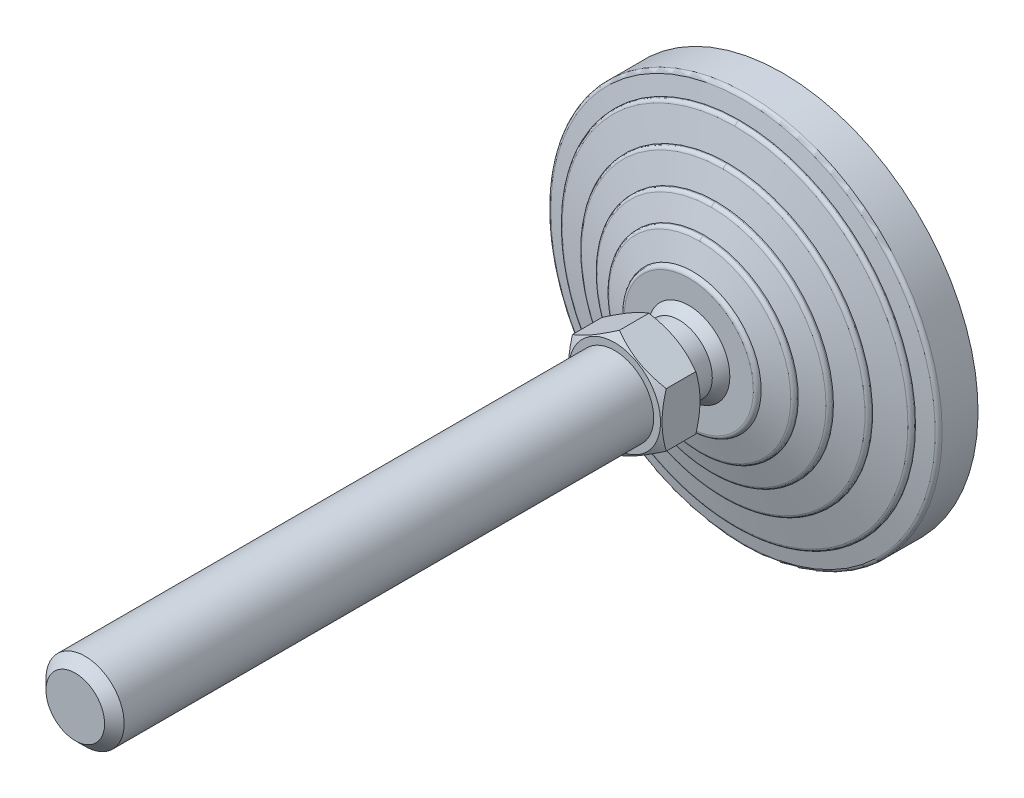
ISO-10303-21;
HEADER;
FILE_DESCRIPTION(('STEP AP214'),'2;1');
FILE_NAME('part.step','',(''),(''),'','','');
FILE_SCHEMA(('AUTOMOTIVE_DESIGN { 1 0 10303 214 1 1 1 1 }'));
ENDSEC;
DATA;
#1=APPLICATION_CONTEXT('core data for automotive mechanical design processes');
#2=APPLICATION_PROTOCOL_DEFINITION('international standard','automotive_design',2000,#1);
#3=PRODUCT_CONTEXT('',#1,'mechanical');
#4=PRODUCT('Part','Part','',(#3));
#5=PRODUCT_RELATED_PRODUCT_CATEGORY('part','',(#4));
#6=PRODUCT_DEFINITION_FORMATION('','',#4);
#7=PRODUCT_DEFINITION_CONTEXT('part definition',#1,'design');
#8=PRODUCT_DEFINITION('design','',#6,#7);
#9=PRODUCT_DEFINITION_SHAPE('','',#8);
#10=(LENGTH_UNIT() NAMED_UNIT(*) SI_UNIT(.MILLI.,.METRE.));
#11=(NAMED_UNIT(*) PLANE_ANGLE_UNIT() SI_UNIT($,.RADIAN.));
#12=(NAMED_UNIT(*) SI_UNIT($,.STERADIAN.) SOLID_ANGLE_UNIT());
#13=UNCERTAINTY_MEASURE_WITH_UNIT(LENGTH_MEASURE(1.E-05),#10,'distance_accuracy_value','');
#14=(GEOMETRIC_REPRESENTATION_CONTEXT(3) GLOBAL_UNCERTAINTY_ASSIGNED_CONTEXT((#13)) GLOBAL_UNIT_ASSIGNED_CONTEXT((#10,
#11,#12)) REPRESENTATION_CONTEXT('',''));
#15=CARTESIAN_POINT('',(0.,0.,0.));
#16=DIRECTION('',(0.,0.,1.));
#17=DIRECTION('',(1.,0.,0.));
#18=AXIS2_PLACEMENT_3D('',#15,#16,#17);
#19=CARTESIAN_POINT('',(-44.173478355,44.022,0.));
#20=DIRECTION('',(0.,0.,1.));
#21=DIRECTION('',(0.,-1.,0.));
#22=AXIS2_PLACEMENT_3D('',#19,#20,#21);
#23=PLANE('',#22);
#24=CARTESIAN_POINT('',(0.,0.,0.));
#25=DIRECTION('',(0.,0.,-1.));
#26=DIRECTION('',(0.,1.,0.));
#27=AXIS2_PLACEMENT_3D('',#24,#25,#26);
#28=CIRCLE('',#27,43.5);
#29=CARTESIAN_POINT('',(0.,43.5,0.));
#30=VERTEX_POINT('',#29);
#31=EDGE_CURVE('E174',#30,#30,#28,.F.);
#32=ORIENTED_EDGE('',*,*,#31,.F.);
#33=EDGE_LOOP('',(#32));
#34=FACE_BOUND('',#33,.T.);
#35=ADVANCED_FACE('F14',(#34),#23,.F.);
#36=CARTESIAN_POINT('',(0.,0.,3.));
#37=DIRECTION('',(0.,0.,-1.));
#38=DIRECTION('',(0.,1.,0.));
#39=AXIS2_PLACEMENT_3D('',#36,#37,#38);
#40=CYLINDRICAL_SURFACE('',#39,43.5);
#41=ORIENTED_EDGE('',*,*,#31,.T.);
#42=EDGE_LOOP('',(#41));
#43=FACE_BOUND('',#42,.T.);
#44=CARTESIAN_POINT('',(0.,0.,3.));
#45=DIRECTION('',(0.,0.,-1.));
#46=DIRECTION('',(0.,1.,0.));
#47=AXIS2_PLACEMENT_3D('',#44,#45,#46);
#48=CIRCLE('',#47,43.5);
#49=CARTESIAN_POINT('',(0.,43.5,3.));
#50=VERTEX_POINT('',#49);
#51=EDGE_CURVE('E172',#50,#50,#48,.T.);
#52=ORIENTED_EDGE('',*,*,#51,.T.);
#53=EDGE_LOOP('',(#52));
#54=FACE_BOUND('',#53,.T.);
#55=ADVANCED_FACE('F326',(#43,#54),#40,.T.);
#56=CARTESIAN_POINT('',(-50.774113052,50.6,3.));
#57=DIRECTION('',(0.,0.,1.));
#58=DIRECTION('',(0.,-1.,0.));
#59=AXIS2_PLACEMENT_3D('',#56,#57,#58);
#60=PLANE('',#59);
#61=ORIENTED_EDGE('',*,*,#51,.F.);
#62=EDGE_LOOP('',(#61));
#63=FACE_BOUND('',#62,.T.);
#64=CARTESIAN_POINT('',(0.,0.,3.));
#65=DIRECTION('',(0.,0.,-1.));
#66=DIRECTION('',(0.,1.,0.));
#67=AXIS2_PLACEMENT_3D('',#64,#65,#66);
#68=CIRCLE('',#67,50.);
#69=CARTESIAN_POINT('',(0.,50.,3.));
#70=VERTEX_POINT('',#69);
#71=EDGE_CURVE('E168',#70,#70,#68,.F.);
#72=ORIENTED_EDGE('',*,*,#71,.F.);
#73=EDGE_LOOP('',(#72));
#74=FACE_BOUND('',#73,.T.);
#75=ADVANCED_FACE('F323',(#63,#74),#60,.F.);
#76=CARTESIAN_POINT('',(0.,0.,12.180196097));
#77=DIRECTION('',(0.,0.,-1.));
#78=DIRECTION('',(0.,1.,0.));
#79=AXIS2_PLACEMENT_3D('',#76,#77,#78);
#80=CYLINDRICAL_SURFACE('',#79,50.);
#81=ORIENTED_EDGE('',*,*,#71,.T.);
#82=EDGE_LOOP('',(#81));
#83=FACE_BOUND('',#82,.T.);
#84=CARTESIAN_POINT('',(0.,0.,12.180196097));
#85=DIRECTION('',(0.,0.,1.));
#86=DIRECTION('',(0.,-1.,0.));
#87=AXIS2_PLACEMENT_3D('',#84,#85,#86);
#88=CIRCLE('',#87,50.);
#89=CARTESIAN_POINT('',(0.,-50.,12.180196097));
#90=VERTEX_POINT('',#89);
#91=EDGE_CURVE('E171',#90,#90,#88,.T.);
#92=ORIENTED_EDGE('',*,*,#91,.F.);
#93=EDGE_LOOP('',(#92));
#94=FACE_BOUND('',#93,.T.);
#95=ADVANCED_FACE('F321',(#83,#94),#80,.T.);
#96=CARTESIAN_POINT('',(0.,0.,12.180196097));
#97=DIRECTION('',(0.,0.,-1.));
#98=DIRECTION('',(0.,1.,0.));
#99=AXIS2_PLACEMENT_3D('',#96,#97,#98);
#100=TOROIDAL_SURFACE('',#99,48.9999999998,1.00000000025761);
#101=ORIENTED_EDGE('',*,*,#91,.T.);
#102=EDGE_LOOP('',(#101));
#103=FACE_BOUND('',#102,.T.);
#104=CARTESIAN_POINT('',(0.,0.,13.160776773));
#105=DIRECTION('',(0.,0.,-1.));
#106=DIRECTION('',(0.,1.,0.));
#107=AXIS2_PLACEMENT_3D('',#104,#105,#106);
#108=CIRCLE('',#107,49.196116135);
#109=CARTESIAN_POINT('',(0.,49.196116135,13.160776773));
#110=VERTEX_POINT('',#109);
#111=EDGE_CURVE('E477',#110,#110,#108,.F.);
#112=ORIENTED_EDGE('',*,*,#111,.F.);
#113=EDGE_LOOP('',(#112));
#114=FACE_BOUND('',#113,.T.);
#115=ADVANCED_FACE('F317',(#103,#114),#100,.T.);
#116=CARTESIAN_POINT('',(0.,0.,14.));
#117=DIRECTION('',(0.,0.,-1.));
#118=DIRECTION('',(1.,0.,0.));
#119=AXIS2_PLACEMENT_3D('',#116,#117,#118);
#120=CONICAL_SURFACE('',#119,45.,1.37340076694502);
#121=ORIENTED_EDGE('',*,*,#111,.T.);
#122=EDGE_LOOP('',(#121));
#123=FACE_BOUND('',#122,.T.);
#124=CARTESIAN_POINT('',(0.,0.,14.));
#125=DIRECTION('',(0.,0.,-1.));
#126=DIRECTION('',(0.,1.,0.));
#127=AXIS2_PLACEMENT_3D('',#124,#125,#126);
#128=CIRCLE('',#127,45.);
#129=CARTESIAN_POINT('',(0.,45.,14.));
#130=VERTEX_POINT('',#129);
#131=EDGE_CURVE('E480',#130,#130,#128,.F.);
#132=ORIENTED_EDGE('',*,*,#131,.F.);
#133=EDGE_LOOP('',(#132));
#134=FACE_BOUND('',#133,.T.);
#135=ADVANCED_FACE('F320',(#123,#134),#120,.T.);
#136=CARTESIAN_POINT('',(0.,0.,14.219223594));
#137=DIRECTION('',(0.,0.,-1.));
#138=DIRECTION('',(1.,0.,0.));
#139=AXIS2_PLACEMENT_3D('',#136,#137,#138);
#140=CYLINDRICAL_SURFACE('',#139,45.);
#141=ORIENTED_EDGE('',*,*,#131,.T.);
#142=EDGE_LOOP('',(#141));
#143=FACE_BOUND('',#142,.T.);
#144=CARTESIAN_POINT('',(0.,0.,14.219223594));
#145=DIRECTION('',(0.,0.,1.));
#146=DIRECTION('',(-1.,0.,0.));
#147=AXIS2_PLACEMENT_3D('',#144,#145,#146);
#148=CIRCLE('',#147,45.);
#149=CARTESIAN_POINT('',(-4.61482714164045E-09,-45.,14.219223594));
#150=VERTEX_POINT('',#149);
#151=CARTESIAN_POINT('',(0.,45.,14.219223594));
#152=VERTEX_POINT('',#151);
#153=EDGE_CURVE('E650',#150,#152,#148,.T.);
#154=ORIENTED_EDGE('',*,*,#153,.F.);
#155=CARTESIAN_POINT('',(0.,0.,14.219223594));
#156=DIRECTION('',(0.,0.,1.));
#157=DIRECTION('',(-1.,0.,0.));
#158=AXIS2_PLACEMENT_3D('',#155,#156,#157);
#159=CIRCLE('',#158,45.);
#160=EDGE_CURVE('E661',#152,#150,#159,.T.);
#161=ORIENTED_EDGE('',*,*,#160,.F.);
#162=EDGE_LOOP('',(#154,#161));
#163=FACE_BOUND('',#162,.T.);
#164=ADVANCED_FACE('F451',(#143,#163),#140,.T.);
#165=CARTESIAN_POINT('',(0.,-45.,14.219223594));
#166=CARTESIAN_POINT('',(-90.0000000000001,-45.,14.219223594));
#167=CARTESIAN_POINT('',(-90.0000000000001,45.,14.219223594));
#168=CARTESIAN_POINT('',(0.,45.,14.219223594));
#169=CARTESIAN_POINT('',(0.,-45.,14.696951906));
#170=CARTESIAN_POINT('',(-90.,-45.,14.696951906));
#171=CARTESIAN_POINT('',(-90.,45.,14.696951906));
#172=CARTESIAN_POINT('',(0.,45.,14.696951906));
#173=CARTESIAN_POINT('',(0.,-44.706000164,15.073499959));
#174=CARTESIAN_POINT('',(-89.412000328,-44.706000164,15.073499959));
#175=CARTESIAN_POINT('',(-89.412000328,44.706000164,15.073499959));
#176=CARTESIAN_POINT('',(0.,44.706000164,15.073499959));
#177=CARTESIAN_POINT('',(0.,-44.242535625,15.189366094));
#178=CARTESIAN_POINT('',(-88.4850712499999,-44.2425356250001,15.189366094));
#179=CARTESIAN_POINT('',(-88.4850712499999,44.2425356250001,15.189366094));
#180=CARTESIAN_POINT('',(0.,44.242535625,15.189366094));
#181=(BOUNDED_SURFACE() B_SPLINE_SURFACE(3,3,((#165,#166,#167,#168),(#169,#170,#171,#172),(#173,
#174,#175,#176),(#177,#178,#179,#180)),.UNSPECIFIED.,.F.,.F.,
.F.) B_SPLINE_SURFACE_WITH_KNOTS((4,4),(4,4),(0.,1.),(0.,1.),
.UNSPECIFIED.) GEOMETRIC_REPRESENTATION_ITEM() RATIONAL_B_SPLINE_SURFACE(((1.,0.333333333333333,
0.333333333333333,1.),(0.858803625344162,0.286267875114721,0.286267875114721,0.858803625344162),
(0.858803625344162,0.286267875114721,0.286267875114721,0.858803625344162),(1.,0.333333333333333,
0.333333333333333,1.))) REPRESENTATION_ITEM('') SURFACE());
#182=CARTESIAN_POINT('',(0.,45.,14.219223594));
#183=CARTESIAN_POINT('',(0.,45.,14.696951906));
#184=CARTESIAN_POINT('',(0.,44.706000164,15.073499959));
#185=CARTESIAN_POINT('',(0.,44.242535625,15.189366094));
#186=(BOUNDED_CURVE() B_SPLINE_CURVE(3,(#182,#183,#184,#185),.UNSPECIFIED.,.F.,
.F.) B_SPLINE_CURVE_WITH_KNOTS((4,4),(0.,1.),
.UNSPECIFIED.) CURVE() GEOMETRIC_REPRESENTATION_ITEM() RATIONAL_B_SPLINE_CURVE((1.,
0.858803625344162,0.858803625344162,1.)) REPRESENTATION_ITEM(''));
#187=CARTESIAN_POINT('',(0.,44.2425356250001,15.1893660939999));
#188=VERTEX_POINT('',#187);
#189=EDGE_CURVE('E641',#152,#188,#186,.T.);
#190=CARTESIAN_POINT('',(0.,-45.,14.219223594));
#191=CARTESIAN_POINT('',(0.,-45.,14.696951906));
#192=CARTESIAN_POINT('',(0.,-44.706000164,15.073499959));
#193=CARTESIAN_POINT('',(0.,-44.242535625,15.189366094));
#194=(BOUNDED_CURVE() B_SPLINE_CURVE(3,(#190,#191,#192,#193),.UNSPECIFIED.,.F.,
.F.) B_SPLINE_CURVE_WITH_KNOTS((4,4),(0.,1.),
.UNSPECIFIED.) CURVE() GEOMETRIC_REPRESENTATION_ITEM() RATIONAL_B_SPLINE_CURVE((1.,
0.858803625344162,0.858803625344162,1.)) REPRESENTATION_ITEM(''));
#195=CARTESIAN_POINT('',(-1.3611443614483E-08,-44.2425356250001,15.1893660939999));
#196=VERTEX_POINT('',#195);
#197=EDGE_CURVE('E655',#196,#150,#194,.F.);
#198=CARTESIAN_POINT('',(0.,0.,15.1893660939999));
#199=DIRECTION('',(0.,0.,-1.));
#200=DIRECTION('',(0.,1.,0.));
#201=AXIS2_PLACEMENT_3D('',#198,#199,#200);
#202=CIRCLE('',#201,44.242535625);
#203=EDGE_CURVE('E638',#188,#196,#202,.F.);
#204=ORIENTED_EDGE('',*,*,#189,.F.);
#205=ORIENTED_EDGE('',*,*,#160,.T.);
#206=ORIENTED_EDGE('',*,*,#197,.F.);
#207=ORIENTED_EDGE('',*,*,#203,.F.);
#208=EDGE_LOOP('',(#204,#205,#206,#207));
#209=FACE_BOUND('',#208,.T.);
#210=ADVANCED_FACE('F440',(#209),#181,.T.);
#211=CARTESIAN_POINT('',(0.,45.,14.219223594));
#212=CARTESIAN_POINT('',(90.0000000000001,45.,14.219223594));
#213=CARTESIAN_POINT('',(90.0000000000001,-45.,14.219223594));
#214=CARTESIAN_POINT('',(0.,-45.,14.219223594));
#215=CARTESIAN_POINT('',(0.,45.,14.696951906));
#216=CARTESIAN_POINT('',(90.,45.,14.696951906));
#217=CARTESIAN_POINT('',(90.,-45.,14.696951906));
#218=CARTESIAN_POINT('',(0.,-45.,14.696951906));
#219=CARTESIAN_POINT('',(0.,44.706000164,15.073499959));
#220=CARTESIAN_POINT('',(89.412000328,44.706000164,15.073499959));
#221=CARTESIAN_POINT('',(89.412000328,-44.706000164,15.073499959));
#222=CARTESIAN_POINT('',(0.,-44.706000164,15.073499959));
#223=CARTESIAN_POINT('',(0.,44.242535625,15.189366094));
#224=CARTESIAN_POINT('',(88.4850712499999,44.2425356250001,15.189366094));
#225=CARTESIAN_POINT('',(88.4850712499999,-44.2425356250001,15.189366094));
#226=CARTESIAN_POINT('',(0.,-44.242535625,15.189366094));
#227=(BOUNDED_SURFACE() B_SPLINE_SURFACE(3,3,((#211,#212,#213,#214),(#215,#216,#217,#218),(#219,
#220,#221,#222),(#223,#224,#225,#226)),.UNSPECIFIED.,.F.,.F.,
.F.) B_SPLINE_SURFACE_WITH_KNOTS((4,4),(4,4),(0.,1.),(0.,1.),
.UNSPECIFIED.) GEOMETRIC_REPRESENTATION_ITEM() RATIONAL_B_SPLINE_SURFACE(((1.,0.333333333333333,
0.333333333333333,1.),(0.858803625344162,0.286267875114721,0.286267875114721,0.858803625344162),
(0.858803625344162,0.286267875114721,0.286267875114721,0.858803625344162),(1.,0.333333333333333,
0.333333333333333,1.))) REPRESENTATION_ITEM('') SURFACE());
#228=CARTESIAN_POINT('',(0.,0.,15.1893660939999));
#229=DIRECTION('',(0.,0.,-1.));
#230=DIRECTION('',(0.,1.,0.));
#231=AXIS2_PLACEMENT_3D('',#228,#229,#230);
#232=CIRCLE('',#231,44.242535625);
#233=EDGE_CURVE('E637',#196,#188,#232,.F.);
#234=ORIENTED_EDGE('',*,*,#153,.T.);
#235=ORIENTED_EDGE('',*,*,#189,.T.);
#236=ORIENTED_EDGE('',*,*,#233,.F.);
#237=ORIENTED_EDGE('',*,*,#197,.T.);
#238=EDGE_LOOP('',(#234,#235,#236,#237));
#239=FACE_BOUND('',#238,.T.);
#240=ADVANCED_FACE('F434',(#239),#227,.T.);
#241=CARTESIAN_POINT('',(0.,0.,17.));
#242=DIRECTION('',(0.,0.,-1.));
#243=DIRECTION('',(0.,1.,0.));
#244=AXIS2_PLACEMENT_3D('',#241,#242,#243);
#245=CONICAL_SURFACE('',#244,37.,1.32581766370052);
#246=ORIENTED_EDGE('',*,*,#203,.T.);
#247=ORIENTED_EDGE('',*,*,#233,.T.);
#248=EDGE_LOOP('',(#246,#247));
#249=FACE_BOUND('',#248,.T.);
#250=CARTESIAN_POINT('',(0.,0.,17.));
#251=DIRECTION('',(0.,0.,-1.));
#252=DIRECTION('',(0.,1.,0.));
#253=AXIS2_PLACEMENT_3D('',#250,#251,#252);
#254=CIRCLE('',#253,37.);
#255=CARTESIAN_POINT('',(0.,37.,17.));
#256=VERTEX_POINT('',#255);
#257=EDGE_CURVE('E628',#256,#256,#254,.F.);
#258=ORIENTED_EDGE('',*,*,#257,.F.);
#259=EDGE_LOOP('',(#258));
#260=FACE_BOUND('',#259,.T.);
#261=ADVANCED_FACE('F430',(#249,#260),#245,.T.);
#262=CARTESIAN_POINT('',(0.,0.,17.245698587));
#263=DIRECTION('',(0.,0.,-1.));
#264=DIRECTION('',(1.,0.,0.));
#265=AXIS2_PLACEMENT_3D('',#262,#263,#264);
#266=CYLINDRICAL_SURFACE('',#265,37.);
#267=ORIENTED_EDGE('',*,*,#257,.T.);
#268=EDGE_LOOP('',(#267));
#269=FACE_BOUND('',#268,.T.);
#270=CARTESIAN_POINT('',(0.,0.,17.245698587));
#271=DIRECTION('',(0.,0.,1.));
#272=DIRECTION('',(0.,-1.,0.));
#273=AXIS2_PLACEMENT_3D('',#270,#271,#272);
#274=CIRCLE('',#273,37.);
#275=CARTESIAN_POINT('',(-3.79441342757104E-09,-37.,17.245698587));
#276=VERTEX_POINT('',#275);
#277=CARTESIAN_POINT('',(0.,37.,17.245698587));
#278=VERTEX_POINT('',#277);
#279=EDGE_CURVE('E608',#276,#278,#274,.T.);
#280=ORIENTED_EDGE('',*,*,#279,.F.);
#281=CARTESIAN_POINT('',(0.,0.,17.245698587));
#282=DIRECTION('',(0.,0.,1.));
#283=DIRECTION('',(0.,-1.,0.));
#284=AXIS2_PLACEMENT_3D('',#281,#282,#283);
#285=CIRCLE('',#284,37.);
#286=EDGE_CURVE('E619',#278,#276,#285,.T.);
#287=ORIENTED_EDGE('',*,*,#286,.F.);
#288=EDGE_LOOP('',(#280,#287));
#289=FACE_BOUND('',#288,.T.);
#290=ADVANCED_FACE('F421',(#269,#289),#266,.T.);
#291=CARTESIAN_POINT('',(0.,-37.,17.245698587));
#292=CARTESIAN_POINT('',(-74.,-37.,17.245698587));
#293=CARTESIAN_POINT('',(-74.,37.,17.245698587));
#294=CARTESIAN_POINT('',(0.,37.,17.245698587));
#295=CARTESIAN_POINT('',(0.,-37.,17.709515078));
#296=CARTESIAN_POINT('',(-74.0000000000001,-37.,17.709515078));
#297=CARTESIAN_POINT('',(-74.0000000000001,37.,17.709515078));
#298=CARTESIAN_POINT('',(0.,37.,17.709515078));
#299=CARTESIAN_POINT('',(0.,-36.720691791,18.079802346));
#300=CARTESIAN_POINT('',(-73.441383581,-36.720691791,18.079802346));
#301=CARTESIAN_POINT('',(-73.441383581,36.720691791,18.079802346));
#302=CARTESIAN_POINT('',(0.,36.720691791,18.079802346));
#303=CARTESIAN_POINT('',(0.,-36.274721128,18.207222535));
#304=CARTESIAN_POINT('',(-72.549442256,-36.274721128,18.207222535));
#305=CARTESIAN_POINT('',(-72.549442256,36.274721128,18.207222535));
#306=CARTESIAN_POINT('',(0.,36.274721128,18.207222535));
#307=(BOUNDED_SURFACE() B_SPLINE_SURFACE(3,3,((#291,#292,#293,#294),(#295,#296,#297,#298),(#299,
#300,#301,#302),(#303,#304,#305,#306)),.UNSPECIFIED.,.F.,.F.,
.F.) B_SPLINE_SURFACE_WITH_KNOTS((4,4),(4,4),(0.,1.),(0.,1.),
.UNSPECIFIED.) GEOMETRIC_REPRESENTATION_ITEM() RATIONAL_B_SPLINE_SURFACE(((1.,0.333333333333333,
0.333333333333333,1.),(0.865565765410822,0.288521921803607,0.288521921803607,0.865565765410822),
(0.865565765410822,0.288521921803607,0.288521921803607,0.865565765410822),(1.,0.333333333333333,
0.333333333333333,1.))) REPRESENTATION_ITEM('') SURFACE());
#308=CARTESIAN_POINT('',(0.,37.,17.245698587));
#309=CARTESIAN_POINT('',(0.,37.,17.709515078));
#310=CARTESIAN_POINT('',(0.,36.720691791,18.079802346));
#311=CARTESIAN_POINT('',(0.,36.274721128,18.207222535));
#312=(BOUNDED_CURVE() B_SPLINE_CURVE(3,(#308,#309,#310,#311),.UNSPECIFIED.,.F.,
.F.) B_SPLINE_CURVE_WITH_KNOTS((4,4),(0.,1.),
.UNSPECIFIED.) CURVE() GEOMETRIC_REPRESENTATION_ITEM() RATIONAL_B_SPLINE_CURVE((1.,
0.865565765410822,0.865565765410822,1.)) REPRESENTATION_ITEM(''));
#313=CARTESIAN_POINT('',(0.,36.2747211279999,18.207222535));
#314=VERTEX_POINT('',#313);
#315=EDGE_CURVE('E599',#278,#314,#312,.T.);
#316=CARTESIAN_POINT('',(0.,-37.,17.245698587));
#317=CARTESIAN_POINT('',(0.,-37.,17.709515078));
#318=CARTESIAN_POINT('',(0.,-36.720691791,18.079802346));
#319=CARTESIAN_POINT('',(0.,-36.274721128,18.207222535));
#320=(BOUNDED_CURVE() B_SPLINE_CURVE(3,(#316,#317,#318,#319),.UNSPECIFIED.,.F.,
.F.) B_SPLINE_CURVE_WITH_KNOTS((4,4),(0.,1.),
.UNSPECIFIED.) CURVE() GEOMETRIC_REPRESENTATION_ITEM() RATIONAL_B_SPLINE_CURVE((1.,
0.865565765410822,0.865565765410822,1.)) REPRESENTATION_ITEM(''));
#321=CARTESIAN_POINT('',(-1.11601045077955E-08,-36.2747211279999,18.207222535));
#322=VERTEX_POINT('',#321);
#323=EDGE_CURVE('E613',#322,#276,#320,.F.);
#324=CARTESIAN_POINT('',(0.,0.,18.207222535));
#325=DIRECTION('',(0.,0.,-1.));
#326=DIRECTION('',(0.,1.,0.));
#327=AXIS2_PLACEMENT_3D('',#324,#325,#326);
#328=CIRCLE('',#327,36.274721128);
#329=EDGE_CURVE('E596',#314,#322,#328,.F.);
#330=ORIENTED_EDGE('',*,*,#315,.F.);
#331=ORIENTED_EDGE('',*,*,#286,.T.);
#332=ORIENTED_EDGE('',*,*,#323,.F.);
#333=ORIENTED_EDGE('',*,*,#329,.F.);
#334=EDGE_LOOP('',(#330,#331,#332,#333));
#335=FACE_BOUND('',#334,.T.);
#336=ADVANCED_FACE('F410',(#335),#307,.T.);
#337=CARTESIAN_POINT('',(0.,37.,17.245698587));
#338=CARTESIAN_POINT('',(74.,37.,17.245698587));
#339=CARTESIAN_POINT('',(74.,-37.,17.245698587));
#340=CARTESIAN_POINT('',(0.,-37.,17.245698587));
#341=CARTESIAN_POINT('',(0.,37.,17.709515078));
#342=CARTESIAN_POINT('',(74.0000000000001,37.,17.709515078));
#343=CARTESIAN_POINT('',(74.0000000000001,-37.,17.709515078));
#344=CARTESIAN_POINT('',(0.,-37.,17.709515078));
#345=CARTESIAN_POINT('',(0.,36.720691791,18.079802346));
#346=CARTESIAN_POINT('',(73.441383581,36.720691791,18.079802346));
#347=CARTESIAN_POINT('',(73.441383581,-36.720691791,18.079802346));
#348=CARTESIAN_POINT('',(0.,-36.720691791,18.079802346));
#349=CARTESIAN_POINT('',(0.,36.274721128,18.207222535));
#350=CARTESIAN_POINT('',(72.549442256,36.274721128,18.207222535));
#351=CARTESIAN_POINT('',(72.549442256,-36.274721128,18.207222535));
#352=CARTESIAN_POINT('',(0.,-36.274721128,18.207222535));
#353=(BOUNDED_SURFACE() B_SPLINE_SURFACE(3,3,((#337,#338,#339,#340),(#341,#342,#343,#344),(#345,
#346,#347,#348),(#349,#350,#351,#352)),.UNSPECIFIED.,.F.,.F.,
.F.) B_SPLINE_SURFACE_WITH_KNOTS((4,4),(4,4),(0.,1.),(0.,1.),
.UNSPECIFIED.) GEOMETRIC_REPRESENTATION_ITEM() RATIONAL_B_SPLINE_SURFACE(((1.,0.333333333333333,
0.333333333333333,1.),(0.865565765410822,0.288521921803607,0.288521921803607,0.865565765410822),
(0.865565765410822,0.288521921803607,0.288521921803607,0.865565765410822),(1.,0.333333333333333,
0.333333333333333,1.))) REPRESENTATION_ITEM('') SURFACE());
#354=CARTESIAN_POINT('',(0.,0.,18.207222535));
#355=DIRECTION('',(0.,0.,-1.));
#356=DIRECTION('',(0.,1.,0.));
#357=AXIS2_PLACEMENT_3D('',#354,#355,#356);
#358=CIRCLE('',#357,36.274721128);
#359=EDGE_CURVE('E595',#322,#314,#358,.F.);
#360=ORIENTED_EDGE('',*,*,#279,.T.);
#361=ORIENTED_EDGE('',*,*,#315,.T.);
#362=ORIENTED_EDGE('',*,*,#359,.F.);
#363=ORIENTED_EDGE('',*,*,#323,.T.);
#364=EDGE_LOOP('',(#360,#361,#362,#363));
#365=FACE_BOUND('',#364,.T.);
#366=ADVANCED_FACE('F404',(#365),#353,.T.);
#367=CARTESIAN_POINT('',(0.,0.,20.));
#368=DIRECTION('',(0.,0.,-1.));
#369=DIRECTION('',(1.,0.,0.));
#370=AXIS2_PLACEMENT_3D('',#367,#368,#369);
#371=CONICAL_SURFACE('',#370,30.,1.29249666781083);
#372=ORIENTED_EDGE('',*,*,#329,.T.);
#373=ORIENTED_EDGE('',*,*,#359,.T.);
#374=EDGE_LOOP('',(#372,#373));
#375=FACE_BOUND('',#374,.T.);
#376=CARTESIAN_POINT('',(0.,0.,20.));
#377=DIRECTION('',(0.,0.,-1.));
#378=DIRECTION('',(0.,1.,0.));
#379=AXIS2_PLACEMENT_3D('',#376,#377,#378);
#380=CIRCLE('',#379,30.);
#381=CARTESIAN_POINT('',(0.,30.,20.));
#382=VERTEX_POINT('',#381);
#383=EDGE_CURVE('E586',#382,#382,#380,.F.);
#384=ORIENTED_EDGE('',*,*,#383,.F.);
#385=EDGE_LOOP('',(#384));
#386=FACE_BOUND('',#385,.T.);
#387=ADVANCED_FACE('F400',(#375,#386),#371,.T.);
#388=CARTESIAN_POINT('',(0.,0.,20.27924078));
#389=DIRECTION('',(0.,0.,-1.));
#390=DIRECTION('',(0.,1.,0.));
#391=AXIS2_PLACEMENT_3D('',#388,#389,#390);
#392=CYLINDRICAL_SURFACE('',#391,30.);
#393=ORIENTED_EDGE('',*,*,#383,.T.);
#394=EDGE_LOOP('',(#393));
#395=FACE_BOUND('',#394,.T.);
#396=CARTESIAN_POINT('',(0.,0.,20.27924078));
#397=DIRECTION('',(0.,0.,1.));
#398=DIRECTION('',(0.,-1.,0.));
#399=AXIS2_PLACEMENT_3D('',#396,#397,#398);
#400=CIRCLE('',#399,30.);
#401=CARTESIAN_POINT('',(-3.0765514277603E-09,-30.,20.27924078));
#402=VERTEX_POINT('',#401);
#403=CARTESIAN_POINT('',(0.,30.,20.27924078));
#404=VERTEX_POINT('',#403);
#405=EDGE_CURVE('E566',#402,#404,#400,.T.);
#406=ORIENTED_EDGE('',*,*,#405,.F.);
#407=CARTESIAN_POINT('',(0.,0.,20.27924078));
#408=DIRECTION('',(0.,0.,1.));
#409=DIRECTION('',(0.,-1.,0.));
#410=AXIS2_PLACEMENT_3D('',#407,#408,#409);
#411=CIRCLE('',#410,30.);
#412=EDGE_CURVE('E577',#404,#402,#411,.T.);
#413=ORIENTED_EDGE('',*,*,#412,.F.);
#414=EDGE_LOOP('',(#406,#413));
#415=FACE_BOUND('',#414,.T.);
#416=ADVANCED_FACE('F391',(#395,#415),#392,.T.);
#417=CARTESIAN_POINT('',(0.,-30.,20.27924078));
#418=CARTESIAN_POINT('',(-60.0000000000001,-30.,20.27924078));
#419=CARTESIAN_POINT('',(-60.0000000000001,30.,20.27924078));
#420=CARTESIAN_POINT('',(0.,30.,20.27924078));
#421=CARTESIAN_POINT('',(0.,-30.,20.725161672));
#422=CARTESIAN_POINT('',(-60.,-30.,20.725161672));
#423=CARTESIAN_POINT('',(-60.,30.,20.725161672));
#424=CARTESIAN_POINT('',(0.,30.,20.725161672));
#425=CARTESIAN_POINT('',(0.,-29.739265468,21.086911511));
#426=CARTESIAN_POINT('',(-59.4785309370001,-29.739265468,21.086911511));
#427=CARTESIAN_POINT('',(-59.4785309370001,29.739265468,21.086911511));
#428=CARTESIAN_POINT('',(0.,29.739265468,21.086911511));
#429=CARTESIAN_POINT('',(0.,-29.316227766,21.227924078));
#430=CARTESIAN_POINT('',(-58.6324555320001,-29.316227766,21.227924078));
#431=CARTESIAN_POINT('',(-58.6324555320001,29.316227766,21.227924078));
#432=CARTESIAN_POINT('',(0.,29.316227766,21.227924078));
#433=(BOUNDED_SURFACE() B_SPLINE_SURFACE(3,3,((#417,#418,#419,#420),(#421,#422,#423,#424),(#425,
#426,#427,#428),(#429,#430,#431,#432)),.UNSPECIFIED.,.F.,.F.,
.F.) B_SPLINE_SURFACE_WITH_KNOTS((4,4),(4,4),(0.,1.),(0.,1.),
.UNSPECIFIED.) GEOMETRIC_REPRESENTATION_ITEM() RATIONAL_B_SPLINE_SURFACE(((1.,0.333333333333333,
0.333333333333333,1.),(0.874161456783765,0.291387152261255,0.291387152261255,0.874161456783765),
(0.874161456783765,0.291387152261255,0.291387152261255,0.874161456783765),(1.,0.333333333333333,
0.333333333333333,1.))) REPRESENTATION_ITEM('') SURFACE());
#434=CARTESIAN_POINT('',(0.,30.,20.27924078));
#435=CARTESIAN_POINT('',(0.,30.,20.725161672));
#436=CARTESIAN_POINT('',(0.,29.739265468,21.086911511));
#437=CARTESIAN_POINT('',(0.,29.316227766,21.227924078));
#438=(BOUNDED_CURVE() B_SPLINE_CURVE(3,(#434,#435,#436,#437),.UNSPECIFIED.,.F.,
.F.) B_SPLINE_CURVE_WITH_KNOTS((4,4),(0.,1.),
.UNSPECIFIED.) CURVE() GEOMETRIC_REPRESENTATION_ITEM() RATIONAL_B_SPLINE_CURVE((1.,
0.874161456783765,0.874161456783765,1.)) REPRESENTATION_ITEM(''));
#439=CARTESIAN_POINT('',(0.,29.316227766,21.227924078));
#440=VERTEX_POINT('',#439);
#441=EDGE_CURVE('E557',#404,#440,#438,.T.);
#442=CARTESIAN_POINT('',(0.,-30.,20.27924078));
#443=CARTESIAN_POINT('',(0.,-30.,20.725161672));
#444=CARTESIAN_POINT('',(0.,-29.739265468,21.086911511));
#445=CARTESIAN_POINT('',(0.,-29.316227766,21.227924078));
#446=(BOUNDED_CURVE() B_SPLINE_CURVE(3,(#442,#443,#444,#445),.UNSPECIFIED.,.F.,
.F.) B_SPLINE_CURVE_WITH_KNOTS((4,4),(0.,1.),
.UNSPECIFIED.) CURVE() GEOMETRIC_REPRESENTATION_ITEM() RATIONAL_B_SPLINE_CURVE((1.,
0.874161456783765,0.874161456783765,1.)) REPRESENTATION_ITEM(''));
#447=CARTESIAN_POINT('',(-9.01928823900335E-09,-29.316227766,21.227924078));
#448=VERTEX_POINT('',#447);
#449=EDGE_CURVE('E571',#448,#402,#446,.F.);
#450=CARTESIAN_POINT('',(0.,0.,21.227924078));
#451=DIRECTION('',(0.,0.,-1.));
#452=DIRECTION('',(0.,1.,0.));
#453=AXIS2_PLACEMENT_3D('',#450,#451,#452);
#454=CIRCLE('',#453,29.316227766);
#455=EDGE_CURVE('E554',#440,#448,#454,.F.);
#456=ORIENTED_EDGE('',*,*,#441,.F.);
#457=ORIENTED_EDGE('',*,*,#412,.T.);
#458=ORIENTED_EDGE('',*,*,#449,.F.);
#459=ORIENTED_EDGE('',*,*,#455,.F.);
#460=EDGE_LOOP('',(#456,#457,#458,#459));
#461=FACE_BOUND('',#460,.T.);
#462=ADVANCED_FACE('F380',(#461),#433,.T.);
#463=CARTESIAN_POINT('',(0.,30.,20.27924078));
#464=CARTESIAN_POINT('',(60.0000000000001,30.,20.27924078));
#465=CARTESIAN_POINT('',(60.0000000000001,-30.,20.27924078));
#466=CARTESIAN_POINT('',(0.,-30.,20.27924078));
#467=CARTESIAN_POINT('',(0.,30.,20.725161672));
#468=CARTESIAN_POINT('',(60.,30.,20.725161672));
#469=CARTESIAN_POINT('',(60.,-30.,20.725161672));
#470=CARTESIAN_POINT('',(0.,-30.,20.725161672));
#471=CARTESIAN_POINT('',(0.,29.739265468,21.086911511));
#472=CARTESIAN_POINT('',(59.4785309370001,29.739265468,21.086911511));
#473=CARTESIAN_POINT('',(59.4785309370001,-29.739265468,21.086911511));
#474=CARTESIAN_POINT('',(0.,-29.739265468,21.086911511));
#475=CARTESIAN_POINT('',(0.,29.316227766,21.227924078));
#476=CARTESIAN_POINT('',(58.6324555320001,29.316227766,21.227924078));
#477=CARTESIAN_POINT('',(58.6324555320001,-29.316227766,21.227924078));
#478=CARTESIAN_POINT('',(0.,-29.316227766,21.227924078));
#479=(BOUNDED_SURFACE() B_SPLINE_SURFACE(3,3,((#463,#464,#465,#466),(#467,#468,#469,#470),(#471,
#472,#473,#474),(#475,#476,#477,#478)),.UNSPECIFIED.,.F.,.F.,
.F.) B_SPLINE_SURFACE_WITH_KNOTS((4,4),(4,4),(0.,1.),(0.,1.),
.UNSPECIFIED.) GEOMETRIC_REPRESENTATION_ITEM() RATIONAL_B_SPLINE_SURFACE(((1.,0.333333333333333,
0.333333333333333,1.),(0.874161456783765,0.291387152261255,0.291387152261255,0.874161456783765),
(0.874161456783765,0.291387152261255,0.291387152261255,0.874161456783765),(1.,0.333333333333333,
0.333333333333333,1.))) REPRESENTATION_ITEM('') SURFACE());
#480=CARTESIAN_POINT('',(0.,0.,21.227924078));
#481=DIRECTION('',(0.,0.,-1.));
#482=DIRECTION('',(0.,1.,0.));
#483=AXIS2_PLACEMENT_3D('',#480,#481,#482);
#484=CIRCLE('',#483,29.316227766);
#485=EDGE_CURVE('E553',#448,#440,#484,.F.);
#486=ORIENTED_EDGE('',*,*,#405,.T.);
#487=ORIENTED_EDGE('',*,*,#441,.T.);
#488=ORIENTED_EDGE('',*,*,#485,.F.);
#489=ORIENTED_EDGE('',*,*,#449,.T.);
#490=EDGE_LOOP('',(#486,#487,#488,#489));
#491=FACE_BOUND('',#490,.T.);
#492=ADVANCED_FACE('F374',(#491),#479,.T.);
#493=CARTESIAN_POINT('',(0.,0.,23.));
#494=DIRECTION('',(0.,0.,-1.));
#495=DIRECTION('',(0.,1.,0.));
#496=AXIS2_PLACEMENT_3D('',#493,#494,#495);
#497=CONICAL_SURFACE('',#496,24.,1.24904577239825);
#498=ORIENTED_EDGE('',*,*,#455,.T.);
#499=ORIENTED_EDGE('',*,*,#485,.T.);
#500=EDGE_LOOP('',(#498,#499));
#501=FACE_BOUND('',#500,.T.);
#502=CARTESIAN_POINT('',(0.,0.,23.));
#503=DIRECTION('',(0.,0.,-1.));
#504=DIRECTION('',(0.,1.,0.));
#505=AXIS2_PLACEMENT_3D('',#502,#503,#504);
#506=CIRCLE('',#505,24.);
#507=CARTESIAN_POINT('',(0.,24.,23.));
#508=VERTEX_POINT('',#507);
#509=EDGE_CURVE('E544',#508,#508,#506,.F.);
#510=ORIENTED_EDGE('',*,*,#509,.F.);
#511=EDGE_LOOP('',(#510));
#512=FACE_BOUND('',#511,.T.);
#513=ADVANCED_FACE('F370',(#501,#512),#497,.T.);
#514=CARTESIAN_POINT('',(0.,0.,23.261425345));
#515=DIRECTION('',(0.,0.,-1.));
#516=DIRECTION('',(0.,1.,0.));
#517=AXIS2_PLACEMENT_3D('',#514,#515,#516);
#518=CYLINDRICAL_SURFACE('',#517,24.);
#519=ORIENTED_EDGE('',*,*,#509,.T.);
#520=EDGE_LOOP('',(#519));
#521=FACE_BOUND('',#520,.T.);
#522=CARTESIAN_POINT('',(0.,0.,23.261425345));
#523=DIRECTION('',(0.,0.,1.));
#524=DIRECTION('',(0.,-1.,0.));
#525=AXIS2_PLACEMENT_3D('',#522,#523,#524);
#526=CIRCLE('',#525,24.);
#527=CARTESIAN_POINT('',(-2.46124114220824E-09,-24.,23.261425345));
#528=VERTEX_POINT('',#527);
#529=CARTESIAN_POINT('',(0.,24.,23.261425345));
#530=VERTEX_POINT('',#529);
#531=EDGE_CURVE('E524',#528,#530,#526,.T.);
#532=ORIENTED_EDGE('',*,*,#531,.F.);
#533=CARTESIAN_POINT('',(0.,0.,23.261425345));
#534=DIRECTION('',(0.,0.,1.));
#535=DIRECTION('',(0.,-1.,0.));
#536=AXIS2_PLACEMENT_3D('',#533,#534,#535);
#537=CIRCLE('',#536,24.);
#538=EDGE_CURVE('E535',#530,#528,#537,.T.);
#539=ORIENTED_EDGE('',*,*,#538,.F.);
#540=EDGE_LOOP('',(#532,#539));
#541=FACE_BOUND('',#540,.T.);
#542=ADVANCED_FACE('F361',(#521,#541),#518,.T.);
#543=CARTESIAN_POINT('',(0.,-24.,23.261425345));
#544=CARTESIAN_POINT('',(-48.,-24.,23.261425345));
#545=CARTESIAN_POINT('',(-48.,24.,23.261425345));
#546=CARTESIAN_POINT('',(0.,24.,23.261425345));
#547=CARTESIAN_POINT('',(0.,-24.,23.716888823));
#548=CARTESIAN_POINT('',(-48.,-24.,23.716888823));
#549=CARTESIAN_POINT('',(-48.,24.,23.716888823));
#550=CARTESIAN_POINT('',(0.,24.,23.716888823));
#551=CARTESIAN_POINT('',(0.,-23.72940828,24.083258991));
#552=CARTESIAN_POINT('',(-47.458816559,-23.72940828,24.083258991));
#553=CARTESIAN_POINT('',(-47.458816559,23.72940828,24.083258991));
#554=CARTESIAN_POINT('',(0.,23.72940828,24.083258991));
#555=CARTESIAN_POINT('',(0.,-23.294085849,24.217204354));
#556=CARTESIAN_POINT('',(-46.5881716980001,-23.294085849,24.217204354));
#557=CARTESIAN_POINT('',(-46.5881716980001,23.294085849,24.217204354));
#558=CARTESIAN_POINT('',(0.,23.294085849,24.217204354));
#559=(BOUNDED_SURFACE() B_SPLINE_SURFACE(3,3,((#543,#544,#545,#546),(#547,#548,#549,#550),(#551,
#552,#553,#554),(#555,#556,#557,#558)),.UNSPECIFIED.,.F.,.F.,
.F.) B_SPLINE_SURFACE_WITH_KNOTS((4,4),(4,4),(0.,1.),(0.,1.),
.UNSPECIFIED.) GEOMETRIC_REPRESENTATION_ITEM() RATIONAL_B_SPLINE_SURFACE(((1.,0.333333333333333,
0.333333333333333,1.),(0.869593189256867,0.289864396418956,0.289864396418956,0.869593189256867),
(0.869593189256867,0.289864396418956,0.289864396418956,0.869593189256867),(1.,0.333333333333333,
0.333333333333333,1.))) REPRESENTATION_ITEM('') SURFACE());
#560=CARTESIAN_POINT('',(0.,24.,23.261425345));
#561=CARTESIAN_POINT('',(0.,24.,23.716888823));
#562=CARTESIAN_POINT('',(0.,23.72940828,24.083258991));
#563=CARTESIAN_POINT('',(0.,23.294085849,24.217204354));
#564=(BOUNDED_CURVE() B_SPLINE_CURVE(3,(#560,#561,#562,#563),.UNSPECIFIED.,.F.,
.F.) B_SPLINE_CURVE_WITH_KNOTS((4,4),(0.,1.),
.UNSPECIFIED.) CURVE() GEOMETRIC_REPRESENTATION_ITEM() RATIONAL_B_SPLINE_CURVE((1.,
0.869593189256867,0.869593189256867,1.)) REPRESENTATION_ITEM(''));
#565=CARTESIAN_POINT('',(0.,23.2940858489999,24.2172043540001));
#566=VERTEX_POINT('',#565);
#567=EDGE_CURVE('E515',#530,#566,#564,.T.);
#568=CARTESIAN_POINT('',(0.,-24.,23.261425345));
#569=CARTESIAN_POINT('',(0.,-24.,23.716888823));
#570=CARTESIAN_POINT('',(0.,-23.72940828,24.083258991));
#571=CARTESIAN_POINT('',(0.,-23.294085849,24.217204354));
#572=(BOUNDED_CURVE() B_SPLINE_CURVE(3,(#568,#569,#570,#571),.UNSPECIFIED.,.F.,
.F.) B_SPLINE_CURVE_WITH_KNOTS((4,4),(0.,1.),
.UNSPECIFIED.) CURVE() GEOMETRIC_REPRESENTATION_ITEM() RATIONAL_B_SPLINE_CURVE((1.,
0.869593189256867,0.869593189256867,1.)) REPRESENTATION_ITEM(''));
#573=CARTESIAN_POINT('',(-7.16654530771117E-09,-23.2940858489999,24.2172043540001));
#574=VERTEX_POINT('',#573);
#575=EDGE_CURVE('E529',#574,#528,#572,.F.);
#576=CARTESIAN_POINT('',(0.,0.,24.2172043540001));
#577=DIRECTION('',(0.,0.,-1.));
#578=DIRECTION('',(0.,1.,0.));
#579=AXIS2_PLACEMENT_3D('',#576,#577,#578);
#580=CIRCLE('',#579,23.294085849);
#581=EDGE_CURVE('E512',#566,#574,#580,.F.);
#582=ORIENTED_EDGE('',*,*,#567,.F.);
#583=ORIENTED_EDGE('',*,*,#538,.T.);
#584=ORIENTED_EDGE('',*,*,#575,.F.);
#585=ORIENTED_EDGE('',*,*,#581,.F.);
#586=EDGE_LOOP('',(#582,#583,#584,#585));
#587=FACE_BOUND('',#586,.T.);
#588=ADVANCED_FACE('F350',(#587),#559,.T.);
#589=CARTESIAN_POINT('',(0.,24.,23.261425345));
#590=CARTESIAN_POINT('',(48.,24.,23.261425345));
#591=CARTESIAN_POINT('',(48.,-24.,23.261425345));
#592=CARTESIAN_POINT('',(0.,-24.,23.261425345));
#593=CARTESIAN_POINT('',(0.,24.,23.716888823));
#594=CARTESIAN_POINT('',(48.,24.,23.716888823));
#595=CARTESIAN_POINT('',(48.,-24.,23.716888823));
#596=CARTESIAN_POINT('',(0.,-24.,23.716888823));
#597=CARTESIAN_POINT('',(0.,23.72940828,24.083258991));
#598=CARTESIAN_POINT('',(47.458816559,23.72940828,24.083258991));
#599=CARTESIAN_POINT('',(47.458816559,-23.72940828,24.083258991));
#600=CARTESIAN_POINT('',(0.,-23.72940828,24.083258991));
#601=CARTESIAN_POINT('',(0.,23.294085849,24.217204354));
#602=CARTESIAN_POINT('',(46.5881716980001,23.294085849,24.217204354));
#603=CARTESIAN_POINT('',(46.5881716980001,-23.294085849,24.217204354));
#604=CARTESIAN_POINT('',(0.,-23.294085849,24.217204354));
#605=(BOUNDED_SURFACE() B_SPLINE_SURFACE(3,3,((#589,#590,#591,#592),(#593,#594,#595,#596),(#597,
#598,#599,#600),(#601,#602,#603,#604)),.UNSPECIFIED.,.F.,.F.,
.F.) B_SPLINE_SURFACE_WITH_KNOTS((4,4),(4,4),(0.,1.),(0.,1.),
.UNSPECIFIED.) GEOMETRIC_REPRESENTATION_ITEM() RATIONAL_B_SPLINE_SURFACE(((1.,0.333333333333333,
0.333333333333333,1.),(0.869593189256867,0.289864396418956,0.289864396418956,0.869593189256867),
(0.869593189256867,0.289864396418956,0.289864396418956,0.869593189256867),(1.,0.333333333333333,
0.333333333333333,1.))) REPRESENTATION_ITEM('') SURFACE());
#606=CARTESIAN_POINT('',(0.,0.,24.2172043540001));
#607=DIRECTION('',(0.,0.,-1.));
#608=DIRECTION('',(0.,1.,0.));
#609=AXIS2_PLACEMENT_3D('',#606,#607,#608);
#610=CIRCLE('',#609,23.294085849);
#611=EDGE_CURVE('E511',#574,#566,#610,.F.);
#612=ORIENTED_EDGE('',*,*,#531,.T.);
#613=ORIENTED_EDGE('',*,*,#567,.T.);
#614=ORIENTED_EDGE('',*,*,#611,.F.);
#615=ORIENTED_EDGE('',*,*,#575,.T.);
#616=EDGE_LOOP('',(#612,#613,#614,#615));
#617=FACE_BOUND('',#616,.T.);
#618=ADVANCED_FACE('F344',(#617),#605,.T.);
#619=CARTESIAN_POINT('',(0.,0.,26.));
#620=DIRECTION('',(0.,0.,-1.));
#621=DIRECTION('',(1.,0.,0.));
#622=AXIS2_PLACEMENT_3D('',#619,#620,#621);
#623=CONICAL_SURFACE('',#622,17.5,1.27229739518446);
#624=ORIENTED_EDGE('',*,*,#581,.T.);
#625=ORIENTED_EDGE('',*,*,#611,.T.);
#626=EDGE_LOOP('',(#624,#625));
#627=FACE_BOUND('',#626,.T.);
#628=CARTESIAN_POINT('',(0.,0.,26.));
#629=DIRECTION('',(0.,0.,1.));
#630=DIRECTION('',(0.,-1.,0.));
#631=AXIS2_PLACEMENT_3D('',#628,#629,#630);
#632=CIRCLE('',#631,17.5);
#633=CARTESIAN_POINT('',(0.,-17.5,26.));
#634=VERTEX_POINT('',#633);
#635=EDGE_CURVE('E167',#634,#634,#632,.T.);
#636=ORIENTED_EDGE('',*,*,#635,.F.);
#637=EDGE_LOOP('',(#636));
#638=FACE_BOUND('',#637,.T.);
#639=ADVANCED_FACE('F315',(#627,#638),#623,.T.);
#640=CARTESIAN_POINT('',(0.,0.,26.));
#641=DIRECTION('',(0.,0.,-1.));
#642=DIRECTION('',(0.,1.,0.));
#643=AXIS2_PLACEMENT_3D('',#640,#641,#642);
#644=TOROIDAL_SURFACE('',#643,16.5,1.);
#645=ORIENTED_EDGE('',*,*,#635,.T.);
#646=EDGE_LOOP('',(#645));
#647=FACE_BOUND('',#646,.T.);
#648=CARTESIAN_POINT('',(0.,0.,27.));
#649=DIRECTION('',(0.,0.,-1.));
#650=DIRECTION('',(0.,1.,0.));
#651=AXIS2_PLACEMENT_3D('',#648,#649,#650);
#652=CIRCLE('',#651,16.499999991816);
#653=CARTESIAN_POINT('',(0.,16.499999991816,27.));
#654=VERTEX_POINT('',#653);
#655=EDGE_CURVE('E164',#654,#654,#652,.T.);
#656=ORIENTED_EDGE('',*,*,#655,.T.);
#657=EDGE_LOOP('',(#656));
#658=FACE_BOUND('',#657,.T.);
#659=ADVANCED_FACE('F311',(#647,#658),#644,.T.);
#660=CARTESIAN_POINT('',(-16.755457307,-16.698,27.));
#661=DIRECTION('',(0.,0.,-1.));
#662=DIRECTION('',(0.,1.,0.));
#663=AXIS2_PLACEMENT_3D('',#660,#661,#662);
#664=PLANE('',#663);
#665=CARTESIAN_POINT('',(0.,0.,27.));
#666=DIRECTION('',(0.,0.,-1.));
#667=DIRECTION('',(0.,1.,0.));
#668=AXIS2_PLACEMENT_3D('',#665,#666,#667);
#669=CIRCLE('',#668,10.4879440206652);
#670=CARTESIAN_POINT('',(0.,10.4879440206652,27.));
#671=VERTEX_POINT('',#670);
#672=EDGE_CURVE('E161',#671,#671,#669,.F.);
#673=ORIENTED_EDGE('',*,*,#672,.F.);
#674=EDGE_LOOP('',(#673));
#675=FACE_BOUND('',#674,.T.);
#676=ORIENTED_EDGE('',*,*,#655,.F.);
#677=EDGE_LOOP('',(#676));
#678=FACE_BOUND('',#677,.T.);
#679=ADVANCED_FACE('F308',(#675,#678),#664,.F.);
#680=CARTESIAN_POINT('',(0.,0.,20.670266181));
#681=DIRECTION('',(0.,0.,-1.));
#682=DIRECTION('',(1.,0.,0.));
#683=AXIS2_PLACEMENT_3D('',#680,#681,#682);
#684=SPHERICAL_SURFACE('',#683,12.25);
#685=ORIENTED_EDGE('',*,*,#672,.T.);
#686=EDGE_LOOP('',(#685));
#687=FACE_BOUND('',#686,.T.);
#688=CARTESIAN_POINT('',(0.,0.,29.5));
#689=DIRECTION('',(0.,0.,-1.));
#690=DIRECTION('',(0.,1.,0.));
#691=AXIS2_PLACEMENT_3D('',#688,#689,#690);
#692=CIRCLE('',#691,8.49107182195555);
#693=CARTESIAN_POINT('',(0.,8.49107182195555,29.5));
#694=VERTEX_POINT('',#693);
#695=EDGE_CURVE('E158',#694,#694,#692,.T.);
#696=ORIENTED_EDGE('',*,*,#695,.T.);
#697=EDGE_LOOP('',(#696));
#698=FACE_BOUND('',#697,.T.);
#699=ADVANCED_FACE('F306',(#687,#698),#684,.T.);
#700=CARTESIAN_POINT('',(-8.631599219,8.622532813,29.5));
#701=DIRECTION('',(0.,0.,1.));
#702=DIRECTION('',(0.,-1.,0.));
#703=AXIS2_PLACEMENT_3D('',#700,#701,#702);
#704=PLANE('',#703);
#705=ORIENTED_EDGE('',*,*,#695,.F.);
#706=EDGE_LOOP('',(#705));
#707=FACE_BOUND('',#706,.T.);
#708=CARTESIAN_POINT('',(0.,0.,29.5));
#709=DIRECTION('',(0.,0.,-1.));
#710=DIRECTION('',(0.,1.,0.));
#711=AXIS2_PLACEMENT_3D('',#708,#709,#710);
#712=CIRCLE('',#711,8.5);
#713=CARTESIAN_POINT('',(0.,8.5,29.5));
#714=VERTEX_POINT('',#713);
#715=EDGE_CURVE('E155',#714,#714,#712,.F.);
#716=ORIENTED_EDGE('',*,*,#715,.F.);
#717=EDGE_LOOP('',(#716));
#718=FACE_BOUND('',#717,.T.);
#719=ADVANCED_FACE('F298',(#707,#718),#704,.F.);
#720=CARTESIAN_POINT('',(0.,0.,36.));
#721=DIRECTION('',(0.,0.,-1.));
#722=DIRECTION('',(0.,1.,0.));
#723=AXIS2_PLACEMENT_3D('',#720,#721,#722);
#724=CYLINDRICAL_SURFACE('',#723,8.5);
#725=ORIENTED_EDGE('',*,*,#715,.T.);
#726=EDGE_LOOP('',(#725));
#727=FACE_BOUND('',#726,.T.);
#728=CARTESIAN_POINT('',(0.,0.,36.));
#729=DIRECTION('',(0.,0.,-1.));
#730=DIRECTION('',(0.,1.,0.));
#731=AXIS2_PLACEMENT_3D('',#728,#729,#730);
#732=CIRCLE('',#731,8.5);
#733=CARTESIAN_POINT('',(0.,8.5,36.));
#734=VERTEX_POINT('',#733);
#735=EDGE_CURVE('E152',#734,#734,#732,.T.);
#736=ORIENTED_EDGE('',*,*,#735,.T.);
#737=EDGE_LOOP('',(#736));
#738=FACE_BOUND('',#737,.T.);
#739=ADVANCED_FACE('F292',(#727,#738),#724,.T.);
#740=CARTESIAN_POINT('',(-12.,14.022683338,36.));
#741=DIRECTION('',(0.,0.,1.));
#742=DIRECTION('',(0.,-1.,0.));
#743=AXIS2_PLACEMENT_3D('',#740,#741,#742);
#744=PLANE('',#743);
#745=CARTESIAN_POINT('',(0.,0.,36.));
#746=DIRECTION('',(0.,0.,-1.));
#747=DIRECTION('',(-1.,0.,0.));
#748=AXIS2_PLACEMENT_3D('',#745,#746,#747);
#749=CIRCLE('',#748,11.75);
#750=CARTESIAN_POINT('',(-11.75,0.,36.));
#751=VERTEX_POINT('',#750);
#752=EDGE_CURVE('E497',#751,#751,#749,.T.);
#753=ORIENTED_EDGE('',*,*,#752,.T.);
#754=EDGE_LOOP('',(#753));
#755=FACE_BOUND('',#754,.T.);
#756=ORIENTED_EDGE('',*,*,#735,.F.);
#757=EDGE_LOOP('',(#756));
#758=FACE_BOUND('',#757,.T.);
#759=ADVANCED_FACE('F223',(#755,#758),#744,.F.);
#760=CARTESIAN_POINT('',(0.,0.,39.2748045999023));
#761=DIRECTION('',(0.,0.,1.));
#762=DIRECTION('',(1.,0.,0.));
#763=AXIS2_PLACEMENT_3D('',#760,#761,#762);
#764=CONICAL_SURFACE('',#763,17.4221279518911,1.0471975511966);
#765=CARTESIAN_POINT('',(-12.,-18.6414689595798,42.0159307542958));
#766=CARTESIAN_POINT('',(-12.,-18.3792886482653,41.8886545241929));
#767=CARTESIAN_POINT('',(-12.,-18.116801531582,41.7620105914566));
#768=CARTESIAN_POINT('',(-12.,-17.5911496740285,41.5101304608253));
#769=CARTESIAN_POINT('',(-12.,-17.3279849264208,41.3848942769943));
#770=CARTESIAN_POINT('',(-12.,-16.5373085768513,41.0114792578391));
#771=CARTESIAN_POINT('',(-12.,-16.0086919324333,40.7656314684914));
#772=CARTESIAN_POINT('',(-12.,-14.9450699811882,40.2803157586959));
#773=CARTESIAN_POINT('',(-12.,-14.4100455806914,40.0408895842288));
#774=CARTESIAN_POINT('',(-12.,-13.3357529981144,39.5717893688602));
#775=CARTESIAN_POINT('',(-12.,-12.7964850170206,39.3421148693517));
#776=CARTESIAN_POINT('',(-12.,-11.695310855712,38.8878633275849));
#777=CARTESIAN_POINT('',(-12.,-11.1332366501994,38.6636914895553));
#778=CARTESIAN_POINT('',(-12.,-10.0025199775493,38.2322370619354));
#779=CARTESIAN_POINT('',(-12.,-9.43387678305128,38.0249563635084));
#780=CARTESIAN_POINT('',(-12.,-8.29019017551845,37.6327058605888));
#781=CARTESIAN_POINT('',(-12.,-7.71516228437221,37.4476911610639));
#782=CARTESIAN_POINT('',(-12.,-6.5568034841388,37.1058781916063));
#783=CARTESIAN_POINT('',(-12.,-5.97347524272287,36.9490710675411));
#784=CARTESIAN_POINT('',(-12.,-5.09377029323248,36.7411043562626));
#785=CARTESIAN_POINT('',(-12.,-4.80056154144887,36.6764633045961));
#786=CARTESIAN_POINT('',(-12.,-4.21213469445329,36.5570293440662));
#787=CARTESIAN_POINT('',(-12.,-3.91691664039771,36.5022362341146));
#788=CARTESIAN_POINT('',(-12.,-3.32467232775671,36.4034633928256));
#789=CARTESIAN_POINT('',(-12.,-3.02764609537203,36.3594835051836));
#790=CARTESIAN_POINT('',(-12.,-2.43209776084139,36.2832132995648));
#791=CARTESIAN_POINT('',(-12.,-2.13357571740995,36.2509225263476));
#792=CARTESIAN_POINT('',(-12.,-1.53936436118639,36.1990786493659));
#793=CARTESIAN_POINT('',(-12.,-1.2436892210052,36.1793640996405));
#794=CARTESIAN_POINT('',(-12.,-0.651770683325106,36.1524581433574));
#795=CARTESIAN_POINT('',(-12.,-0.355527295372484,36.1452665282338));
#796=CARTESIAN_POINT('',(-12.,0.236998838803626,36.1435775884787));
#797=CARTESIAN_POINT('',(-12.,0.533281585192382,36.1490803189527));
#798=CARTESIAN_POINT('',(-12.,1.12535062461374,36.1726455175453));
#799=CARTESIAN_POINT('',(-12.,1.42113689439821,36.190708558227));
#800=CARTESIAN_POINT('',(-12.,2.13104717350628,36.2487506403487));
#801=CARTESIAN_POINT('',(-12.,2.54469684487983,36.2946359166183));
#802=CARTESIAN_POINT('',(-12.,3.36894943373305,36.4084796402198));
#803=CARTESIAN_POINT('',(-12.,3.77955193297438,36.4764410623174));
#804=CARTESIAN_POINT('',(-12.,4.59731069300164,36.6320195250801));
#805=CARTESIAN_POINT('',(-12.,5.00446402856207,36.7196517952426));
#806=CARTESIAN_POINT('',(-12.,5.814697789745,36.9118960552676));
#807=CARTESIAN_POINT('',(-12.,6.21777827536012,37.016507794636));
#808=CARTESIAN_POINT('',(-12.,7.02875641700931,37.2426432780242));
#809=CARTESIAN_POINT('',(-12.,7.43656340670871,37.3644899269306));
#810=CARTESIAN_POINT('',(-12.,8.24816038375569,37.6208304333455));
#811=CARTESIAN_POINT('',(-12.,8.65195034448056,37.7553243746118));
#812=CARTESIAN_POINT('',(-12.,9.45571190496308,38.0348189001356));
#813=CARTESIAN_POINT('',(-12.,9.8556847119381,38.179816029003));
#814=CARTESIAN_POINT('',(-12.,10.6523120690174,38.4786053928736));
#815=CARTESIAN_POINT('',(-12.,11.0489666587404,38.6323975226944));
#816=CARTESIAN_POINT('',(-12.,11.9879189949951,39.0065229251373));
#817=CARTESIAN_POINT('',(-12.,12.5289081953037,39.2301354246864));
#818=CARTESIAN_POINT('',(-12.,13.6062562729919,39.688281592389));
#819=CARTESIAN_POINT('',(-12.,14.1426148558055,39.922815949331));
#820=CARTESIAN_POINT('',(-12.,15.2115690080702,40.400608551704));
#821=CARTESIAN_POINT('',(-12.,15.7441636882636,40.6438687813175));
#822=CARTESIAN_POINT('',(-12.,16.8060988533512,41.1373441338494));
#823=CARTESIAN_POINT('',(-12.,17.3354394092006,41.3875591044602));
#824=CARTESIAN_POINT('',(-12.,18.3919962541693,41.8939192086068));
#825=CARTESIAN_POINT('',(-12.,18.9192095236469,42.1500706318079));
#826=CARTESIAN_POINT('',(-12.,19.9713543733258,42.6670166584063));
#827=CARTESIAN_POINT('',(-12.,20.4962859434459,42.9278112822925));
#828=CARTESIAN_POINT('',(-12.,21.5441504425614,43.4532098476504));
#829=CARTESIAN_POINT('',(-12.,22.0670836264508,43.7178132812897));
#830=CARTESIAN_POINT('',(-12.,23.1113104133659,44.2502375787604));
#831=CARTESIAN_POINT('',(-12.,23.6326040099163,44.5180584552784));
#832=CARTESIAN_POINT('',(-12.,25.1063969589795,45.2800760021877));
#833=CARTESIAN_POINT('',(-12.,26.0572536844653,45.7774495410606));
#834=CARTESIAN_POINT('',(-12.,27.9554351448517,46.7789579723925));
#835=CARTESIAN_POINT('',(-12.,28.9027597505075,47.2830931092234));
#836=CARTESIAN_POINT('',(-12.,30.7922487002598,48.295256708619));
#837=CARTESIAN_POINT('',(-12.,31.7344200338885,48.8032721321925));
#838=CARTESIAN_POINT('',(-12.,33.146012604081,49.5683003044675));
#839=CARTESIAN_POINT('',(-12.,33.6162531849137,49.8238034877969));
#840=CARTESIAN_POINT('',(-12.,34.5562425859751,50.3357111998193));
#841=CARTESIAN_POINT('',(-12.,35.0259914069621,50.5921157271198));
#842=CARTESIAN_POINT('',(-12.,35.4955222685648,50.8489188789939));
#843=B_SPLINE_CURVE_WITH_KNOTS('',3,(#765,#766,#767,#768,#769,#770,#771,#772,#773,#774,#775,
#776,#777,#778,#779,#780,#781,#782,#783,#784,#785,#786,#787,#788,#789,#790,#791,#792,#793,#794,
#795,#796,#797,#798,#799,#800,#801,#802,#803,#804,#805,#806,#807,#808,#809,#810,#811,#812,#813,
#814,#815,#816,#817,#818,#819,#820,#821,#822,#823,#824,#825,#826,#827,#828,#829,#830,#831,#832,
#833,#834,#835,#836,#837,#838,#839,#840,#841,#842),.UNSPECIFIED.,.F.,.F.,(4,2,2,2,2,2,2,2,2,2,2,
2,2,2,2,2,2,2,2,2,2,2,2,2,2,2,2,2,2,2,2,2,2,2,2,2,2,2,4),(0.,0.874320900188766,1.74865052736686,
3.49756689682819,5.25595175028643,7.01425381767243,8.82943184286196,10.644812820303,
12.4564698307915,14.2675571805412,15.1681674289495,16.0687592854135,16.9693381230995,
17.8698818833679,18.7586191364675,19.6473415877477,20.5360678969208,21.4248347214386,
22.6727055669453,23.920744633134,25.1697533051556,26.4187435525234,27.6953611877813,
28.9719872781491,30.2481952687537,31.5243879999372,33.2803701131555,35.0364631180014,
36.7929580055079,38.549414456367,40.3078256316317,42.066244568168,43.8244311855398,
45.5826247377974,48.8018350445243,52.021162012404,55.2323630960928,56.8378755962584,
58.4433856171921),.UNSPECIFIED.);
#844=CARTESIAN_POINT('',(-12.,-6.92820323,37.2161343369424));
#845=VERTEX_POINT('',#844);
#846=CARTESIAN_POINT('',(-12.,6.92820323,37.2161343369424));
#847=VERTEX_POINT('',#846);
#848=EDGE_CURVE('E121',#845,#847,#843,.T.);
#849=ORIENTED_EDGE('',*,*,#848,.T.);
#850=CARTESIAN_POINT('',(-21.9253506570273,1.19779935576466,41.8936173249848));
#851=CARTESIAN_POINT('',(-21.6930919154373,1.33189400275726,41.7639484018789));
#852=CARTESIAN_POINT('',(-21.4605478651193,1.46615337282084,41.6349611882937));
#853=CARTESIAN_POINT('',(-20.9948275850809,1.73503710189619,41.3785098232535));
#854=CARTESIAN_POINT('',(-20.7616513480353,1.8696614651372,41.2510456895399));
#855=CARTESIAN_POINT('',(-20.061008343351,2.27417789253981,40.8711375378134));
#856=CARTESIAN_POINT('',(-19.5925085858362,2.54466635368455,40.62122329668));
#857=CARTESIAN_POINT('',(-18.6492508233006,3.08925647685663,40.128252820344));
#858=CARTESIAN_POINT('',(-18.1744719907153,3.36337016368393,39.8852495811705));
#859=CARTESIAN_POINT('',(-17.2209088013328,3.91391012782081,39.4099989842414));
#860=CARTESIAN_POINT('',(-16.7421246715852,4.19033627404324,39.1777510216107));
#861=CARTESIAN_POINT('',(-15.7747392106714,4.74885653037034,38.7246279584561));
#862=CARTESIAN_POINT('',(-15.2860875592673,5.03097969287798,38.5038953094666));
#863=CARTESIAN_POINT('',(-14.3028442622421,5.5986554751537,38.0804534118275));
#864=CARTESIAN_POINT('',(-13.8082519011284,5.88420850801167,37.8777463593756));
#865=CARTESIAN_POINT('',(-12.813475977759,6.45854265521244,37.496185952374));
#866=CARTESIAN_POINT('',(-12.3133087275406,6.74731435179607,37.3172763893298));
#867=CARTESIAN_POINT('',(-11.3056669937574,7.32907657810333,36.98950850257));
#868=CARTESIAN_POINT('',(-10.7981951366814,7.62206559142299,36.8406396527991));
#869=CARTESIAN_POINT('',(-10.0373662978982,8.06133032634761,36.6472113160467));
#870=CARTESIAN_POINT('',(-9.78673724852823,8.20603107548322,36.5882350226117));
#871=CARTESIAN_POINT('',(-9.2838631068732,8.49636559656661,36.480265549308));
#872=CARTESIAN_POINT('',(-9.03161805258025,8.64199934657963,36.4312721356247));
#873=CARTESIAN_POINT('',(-8.52569338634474,8.93409508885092,36.3441514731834));
#874=CARTESIAN_POINT('',(-8.27201364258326,9.08055715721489,36.3060252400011));
#875=CARTESIAN_POINT('',(-7.76354534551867,9.37412146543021,36.2414163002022));
#876=CARTESIAN_POINT('',(-7.50875682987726,9.52122368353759,36.2149332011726));
#877=CARTESIAN_POINT('',(-6.99994934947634,9.81498381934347,36.174310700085));
#878=CARTESIAN_POINT('',(-6.74593472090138,9.96163923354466,36.1600993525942));
#879=CARTESIAN_POINT('',(-6.23761415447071,10.2551182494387,36.1440812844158));
#880=CARTESIAN_POINT('',(-5.98330822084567,10.401941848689,36.1422743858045));
#881=CARTESIAN_POINT('',(-5.47492366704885,10.6954578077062,36.1511071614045));
#882=CARTESIAN_POINT('',(-5.22084500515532,10.8421501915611,36.1617436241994));
#883=CARTESIAN_POINT('',(-4.71328703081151,11.1351889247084,36.1952083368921));
#884=CARTESIAN_POINT('',(-4.45980775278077,11.2815352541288,36.2180372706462));
#885=CARTESIAN_POINT('',(-3.83746420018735,11.6408454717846,36.288591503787));
#886=CARTESIAN_POINT('',(-3.46915270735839,11.8534902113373,36.3429383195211));
#887=CARTESIAN_POINT('',(-2.73558486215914,12.2770158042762,36.4742772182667));
#888=CARTESIAN_POINT('',(-2.37032900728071,12.4878963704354,36.5512729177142));
#889=CARTESIAN_POINT('',(-1.27842348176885,13.1183083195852,36.8123482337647));
#890=CARTESIAN_POINT('',(-0.557083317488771,13.5347742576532,37.0263316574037));
#891=CARTESIAN_POINT('',(0.521544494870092,14.1575203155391,37.392850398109));
#892=CARTESIAN_POINT('',(0.8845152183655,14.367081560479,37.5243304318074));
#893=CARTESIAN_POINT('',(1.60695022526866,14.7841796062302,37.7997846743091));
#894=CARTESIAN_POINT('',(1.96641420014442,14.9917162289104,37.9437599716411));
#895=CARTESIAN_POINT('',(2.68003662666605,15.4037263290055,38.2411839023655));
#896=CARTESIAN_POINT('',(3.03421367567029,15.6082105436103,38.3945735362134));
#897=CARTESIAN_POINT('',(3.56327885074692,15.9136664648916,38.6309976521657));
#898=CARTESIAN_POINT('',(3.73923959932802,16.0152574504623,38.7108492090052));
#899=CARTESIAN_POINT('',(4.09048791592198,16.2180507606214,38.8724924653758));
#900=CARTESIAN_POINT('',(4.2657754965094,16.3192530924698,38.9542841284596));
#901=CARTESIAN_POINT('',(4.44075044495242,16.4202749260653,39.0369573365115));
#902=B_SPLINE_CURVE_WITH_KNOTS('',3,(#850,#851,#852,#853,#854,#855,#856,#857,#858,#859,#860,
#861,#862,#863,#864,#865,#866,#867,#868,#869,#870,#871,#872,#873,#874,#875,#876,#877,#878,#879,
#880,#881,#882,#883,#884,#885,#886,#887,#888,#889,#890,#891,#892,#893,#894,#895,#896,#897,#898,
#899,#900,#901),.UNSPECIFIED.,.F.,.F.,(4,2,2,2,2,2,2,2,2,2,2,2,2,2,2,2,2,2,2,2,2,2,2,2,2,4),(0.,
0.893673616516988,1.78735763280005,3.57503866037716,5.37395911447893,7.1727782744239,
8.99020002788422,10.8078429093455,12.621113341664,14.4337473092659,15.3196522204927,
16.2055363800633,17.0915033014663,17.9774403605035,18.85814748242,19.7388419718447,
20.6193092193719,21.4998258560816,22.7853327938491,24.0710451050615,26.6474921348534,
27.9651818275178,29.2829864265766,30.5932411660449,31.2481619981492,31.9030705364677),.UNSPECIFIED.);
#903=CARTESIAN_POINT('',(0.,13.856406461,37.2161343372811));
#904=VERTEX_POINT('',#903);
#905=EDGE_CURVE('E133',#847,#904,#902,.T.);
#906=ORIENTED_EDGE('',*,*,#905,.T.);
#907=CARTESIAN_POINT('',(-1.63178422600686,14.798517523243,37.8118472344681));
#908=CARTESIAN_POINT('',(-1.33648192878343,14.6280246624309,37.6953476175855));
#909=CARTESIAN_POINT('',(-1.03999714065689,14.4568490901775,37.5827201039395));
#910=CARTESIAN_POINT('',(-0.44442264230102,14.1129939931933,37.3666047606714));
#911=CARTESIAN_POINT('',(-0.14533199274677,13.940313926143,37.2631203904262));
#912=CARTESIAN_POINT('',(0.456727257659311,13.5927148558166,37.0663664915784));
#913=CARTESIAN_POINT('',(0.7597068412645,13.4177895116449,36.9731414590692));
#914=CARTESIAN_POINT('',(1.36830405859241,13.0664157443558,36.7990702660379));
#915=CARTESIAN_POINT('',(1.6739214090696,12.8899674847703,36.7182227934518));
#916=CARTESIAN_POINT('',(2.2781920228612,12.5410916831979,36.5729137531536));
#917=CARTESIAN_POINT('',(2.57676711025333,12.3687092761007,36.5080215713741));
#918=CARTESIAN_POINT('',(3.17606690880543,12.0227033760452,36.3930193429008));
#919=CARTESIAN_POINT('',(3.47679164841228,11.849079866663,36.3429094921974));
#920=CARTESIAN_POINT('',(4.07936424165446,11.501184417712,36.2589314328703));
#921=CARTESIAN_POINT('',(4.38120881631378,11.3269143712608,36.2250321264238));
#922=CARTESIAN_POINT('',(4.9859770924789,10.977751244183,36.1743679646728));
#923=CARTESIAN_POINT('',(5.28890075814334,10.8028581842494,36.1576025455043));
#924=CARTESIAN_POINT('',(5.87648776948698,10.4636146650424,36.1422339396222));
#925=CARTESIAN_POINT('',(6.16113068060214,10.2992760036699,36.1425791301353));
#926=CARTESIAN_POINT('',(6.73008148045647,9.97079210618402,36.1588280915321));
#927=CARTESIAN_POINT('',(7.0143893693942,9.80664686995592,36.1747318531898));
#928=CARTESIAN_POINT('',(7.58251808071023,9.47863760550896,36.2216802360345));
#929=CARTESIAN_POINT('',(7.86633738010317,9.3147744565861,36.2527492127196));
#930=CARTESIAN_POINT('',(8.43251167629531,8.98789357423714,36.3291971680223));
#931=CARTESIAN_POINT('',(8.71486668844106,8.8248758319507,36.3745759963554));
#932=CARTESIAN_POINT('',(9.28604342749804,8.49510678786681,36.4800650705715));
#933=CARTESIAN_POINT('',(9.57481003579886,8.32838730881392,36.5405706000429));
#934=CARTESIAN_POINT('',(10.1501987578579,7.99618647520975,36.6742066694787));
#935=CARTESIAN_POINT('',(10.4368203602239,7.83070541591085,36.7473401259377));
#936=CARTESIAN_POINT('',(11.006858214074,7.50159390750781,36.9045513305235));
#937=CARTESIAN_POINT('',(11.2902815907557,7.33795934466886,36.9885948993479));
#938=CARTESIAN_POINT('',(11.8546844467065,7.01210120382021,37.1664141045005));
#939=CARTESIAN_POINT('',(12.1356650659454,6.84987696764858,37.2601849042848));
#940=CARTESIAN_POINT('',(12.4155013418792,6.68831341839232,37.3581695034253));
#941=B_SPLINE_CURVE_WITH_KNOTS('',3,(#907,#908,#909,#910,#911,#912,#913,#914,#915,#916,#917,
#918,#919,#920,#921,#922,#923,#924,#925,#926,#927,#928,#929,#930,#931,#932,#933,#934,#935,#936,
#937,#938,#939,#940),.UNSPECIFIED.,.F.,.F.,(4,2,2,2,2,2,2,2,2,2,2,2,2,2,2,2,4),(0.,
1.08105048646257,2.16250826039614,3.24848554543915,4.33434763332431,5.38651500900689,
6.43869633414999,7.48885100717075,8.53897111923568,9.52463559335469,10.5102994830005,
11.4975515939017,12.4847933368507,13.5011749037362,14.5177915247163,15.5312968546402,
16.5443006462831),.UNSPECIFIED.);
#942=CARTESIAN_POINT('',(12.,6.92820323,37.2161343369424));
#943=VERTEX_POINT('',#942);
#944=EDGE_CURVE('E243',#904,#943,#941,.T.);
#945=ORIENTED_EDGE('',*,*,#944,.T.);
#946=CARTESIAN_POINT('',(12.,-18.6414689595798,42.0159307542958));
#947=CARTESIAN_POINT('',(12.,-18.3792886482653,41.8886545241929));
#948=CARTESIAN_POINT('',(12.,-18.116801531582,41.7620105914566));
#949=CARTESIAN_POINT('',(12.,-17.5911496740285,41.5101304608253));
#950=CARTESIAN_POINT('',(12.,-17.3279849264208,41.3848942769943));
#951=CARTESIAN_POINT('',(12.,-16.5373085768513,41.0114792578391));
#952=CARTESIAN_POINT('',(12.,-16.0086919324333,40.7656314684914));
#953=CARTESIAN_POINT('',(12.,-14.9450699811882,40.2803157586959));
#954=CARTESIAN_POINT('',(12.,-14.4100455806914,40.0408895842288));
#955=CARTESIAN_POINT('',(12.,-13.3357529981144,39.5717893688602));
#956=CARTESIAN_POINT('',(12.,-12.7964850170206,39.3421148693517));
#957=CARTESIAN_POINT('',(12.,-11.695310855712,38.8878633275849));
#958=CARTESIAN_POINT('',(12.,-11.1332366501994,38.6636914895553));
#959=CARTESIAN_POINT('',(12.,-10.0025199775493,38.2322370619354));
#960=CARTESIAN_POINT('',(12.,-9.43387678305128,38.0249563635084));
#961=CARTESIAN_POINT('',(12.,-8.29019017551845,37.6327058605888));
#962=CARTESIAN_POINT('',(12.,-7.71516228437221,37.4476911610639));
#963=CARTESIAN_POINT('',(12.,-6.5568034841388,37.1058781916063));
#964=CARTESIAN_POINT('',(12.,-5.97347524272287,36.9490710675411));
#965=CARTESIAN_POINT('',(12.,-5.09377029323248,36.7411043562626));
#966=CARTESIAN_POINT('',(12.,-4.80056154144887,36.6764633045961));
#967=CARTESIAN_POINT('',(12.,-4.21213469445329,36.5570293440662));
#968=CARTESIAN_POINT('',(12.,-3.91691664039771,36.5022362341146));
#969=CARTESIAN_POINT('',(12.,-3.32467232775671,36.4034633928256));
#970=CARTESIAN_POINT('',(12.,-3.02764609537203,36.3594835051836));
#971=CARTESIAN_POINT('',(12.,-2.43209776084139,36.2832132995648));
#972=CARTESIAN_POINT('',(12.,-2.13357571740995,36.2509225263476));
#973=CARTESIAN_POINT('',(12.,-1.53936436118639,36.1990786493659));
#974=CARTESIAN_POINT('',(12.,-1.2436892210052,36.1793640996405));
#975=CARTESIAN_POINT('',(12.,-0.651770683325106,36.1524581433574));
#976=CARTESIAN_POINT('',(12.,-0.355527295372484,36.1452665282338));
#977=CARTESIAN_POINT('',(12.,0.236998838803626,36.1435775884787));
#978=CARTESIAN_POINT('',(12.,0.533281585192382,36.1490803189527));
#979=CARTESIAN_POINT('',(12.,1.12535062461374,36.1726455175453));
#980=CARTESIAN_POINT('',(12.,1.42113689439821,36.190708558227));
#981=CARTESIAN_POINT('',(12.,2.13104717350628,36.2487506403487));
#982=CARTESIAN_POINT('',(12.,2.54469684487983,36.2946359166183));
#983=CARTESIAN_POINT('',(12.,3.36894943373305,36.4084796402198));
#984=CARTESIAN_POINT('',(12.,3.77955193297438,36.4764410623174));
#985=CARTESIAN_POINT('',(12.,4.59731069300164,36.6320195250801));
#986=CARTESIAN_POINT('',(12.,5.00446402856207,36.7196517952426));
#987=CARTESIAN_POINT('',(12.,5.814697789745,36.9118960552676));
#988=CARTESIAN_POINT('',(12.,6.21777827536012,37.016507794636));
#989=CARTESIAN_POINT('',(12.,7.02875641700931,37.2426432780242));
#990=CARTESIAN_POINT('',(12.,7.43656340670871,37.3644899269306));
#991=CARTESIAN_POINT('',(12.,8.24816038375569,37.6208304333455));
#992=CARTESIAN_POINT('',(12.,8.65195034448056,37.7553243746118));
#993=CARTESIAN_POINT('',(12.,9.45571190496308,38.0348189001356));
#994=CARTESIAN_POINT('',(12.,9.8556847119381,38.179816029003));
#995=CARTESIAN_POINT('',(12.,10.6523120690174,38.4786053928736));
#996=CARTESIAN_POINT('',(12.,11.0489666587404,38.6323975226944));
#997=CARTESIAN_POINT('',(12.,11.9879189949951,39.0065229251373));
#998=CARTESIAN_POINT('',(12.,12.5289081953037,39.2301354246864));
#999=CARTESIAN_POINT('',(12.,13.6062562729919,39.688281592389));
#1000=CARTESIAN_POINT('',(12.,14.1426148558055,39.922815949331));
#1001=CARTESIAN_POINT('',(12.,15.2115690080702,40.400608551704));
#1002=CARTESIAN_POINT('',(12.,15.7441636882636,40.6438687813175));
#1003=CARTESIAN_POINT('',(12.,16.8060988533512,41.1373441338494));
#1004=CARTESIAN_POINT('',(12.,17.3354394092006,41.3875591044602));
#1005=CARTESIAN_POINT('',(12.,18.3919962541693,41.8939192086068));
#1006=CARTESIAN_POINT('',(12.,18.9192095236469,42.1500706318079));
#1007=CARTESIAN_POINT('',(12.,19.9713543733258,42.6670166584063));
#1008=CARTESIAN_POINT('',(12.,20.4962859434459,42.9278112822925));
#1009=CARTESIAN_POINT('',(12.,21.5441504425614,43.4532098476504));
#1010=CARTESIAN_POINT('',(12.,22.0670836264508,43.7178132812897));
#1011=CARTESIAN_POINT('',(12.,23.1113104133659,44.2502375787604));
#1012=CARTESIAN_POINT('',(12.,23.6326040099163,44.5180584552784));
#1013=CARTESIAN_POINT('',(12.,25.1063969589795,45.2800760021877));
#1014=CARTESIAN_POINT('',(12.,26.0572536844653,45.7774495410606));
#1015=CARTESIAN_POINT('',(12.,27.9554351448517,46.7789579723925));
#1016=CARTESIAN_POINT('',(12.,28.9027597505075,47.2830931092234));
#1017=CARTESIAN_POINT('',(12.,30.7922487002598,48.295256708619));
#1018=CARTESIAN_POINT('',(12.,31.7344200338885,48.8032721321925));
#1019=CARTESIAN_POINT('',(12.,33.146012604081,49.5683003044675));
#1020=CARTESIAN_POINT('',(12.,33.6162531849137,49.8238034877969));
#1021=CARTESIAN_POINT('',(12.,34.5562425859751,50.3357111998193));
#1022=CARTESIAN_POINT('',(12.,35.0259914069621,50.5921157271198));
#1023=CARTESIAN_POINT('',(12.,35.4955222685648,50.8489188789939));
#1024=B_SPLINE_CURVE_WITH_KNOTS('',3,(#946,#947,#948,#949,#950,#951,#952,#953,#954,#955,#956,
#957,#958,#959,#960,#961,#962,#963,#964,#965,#966,#967,#968,#969,#970,#971,#972,#973,#974,#975,
#976,#977,#978,#979,#980,#981,#982,#983,#984,#985,#986,#987,#988,#989,#990,#991,#992,#993,#994,
#995,#996,#997,#998,#999,#1000,#1001,#1002,#1003,#1004,#1005,#1006,#1007,#1008,#1009,#1010,
#1011,#1012,#1013,#1014,#1015,#1016,#1017,#1018,#1019,#1020,#1021,#1022,#1023),.UNSPECIFIED.,
.F.,.F.,(4,2,2,2,2,2,2,2,2,2,2,2,2,2,2,2,2,2,2,2,2,2,2,2,2,2,2,2,2,2,2,2,2,2,2,2,2,2,4),(0.,
0.874320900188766,1.74865052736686,3.49756689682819,5.25595175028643,7.01425381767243,
8.82943184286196,10.644812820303,12.4564698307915,14.2675571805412,15.1681674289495,
16.0687592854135,16.9693381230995,17.8698818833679,18.7586191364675,19.6473415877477,
20.5360678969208,21.4248347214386,22.6727055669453,23.920744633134,25.1697533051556,
26.4187435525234,27.6953611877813,28.9719872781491,30.2481952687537,31.5243879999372,
33.2803701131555,35.0364631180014,36.7929580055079,38.549414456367,40.3078256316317,
42.066244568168,43.8244311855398,45.5826247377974,48.8018350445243,52.021162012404,
55.2323630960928,56.8378755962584,58.4433856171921),.UNSPECIFIED.);
#1025=CARTESIAN_POINT('',(12.,-6.92820323,37.2161343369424));
#1026=VERTEX_POINT('',#1025);
#1027=EDGE_CURVE('E237',#943,#1026,#1024,.F.);
#1028=ORIENTED_EDGE('',*,*,#1027,.T.);
#1029=CARTESIAN_POINT('',(-9.94077959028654,-19.5957182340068,41.902232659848));
#1030=CARTESIAN_POINT('',(-9.70857059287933,-19.4616523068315,41.7725540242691));
#1031=CARTESIAN_POINT('',(-9.47607693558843,-19.3274220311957,41.6435553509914));
#1032=CARTESIAN_POINT('',(-9.01045892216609,-19.0585973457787,41.3870770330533));
#1033=CARTESIAN_POINT('',(-8.77733455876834,-18.9240029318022,41.2595974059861));
#1034=CARTESIAN_POINT('',(-8.07685010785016,-18.5195780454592,40.879636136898));
#1035=CARTESIAN_POINT('',(-7.6084594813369,-18.2491525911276,40.6296773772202));
#1036=CARTESIAN_POINT('',(-6.6654452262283,-17.704703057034,40.1366018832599));
#1037=CARTESIAN_POINT('',(-6.19080093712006,-17.4306670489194,39.8935376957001));
#1038=CARTESIAN_POINT('',(-5.23751689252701,-16.8802882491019,39.4181315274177));
#1039=CARTESIAN_POINT('',(-4.75887736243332,-16.6039455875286,39.1857889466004));
#1040=CARTESIAN_POINT('',(-3.79168902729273,-16.0455391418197,38.7323807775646));
#1041=CARTESIAN_POINT('',(-3.30308895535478,-15.7634457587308,38.5114602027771));
#1042=CARTESIAN_POINT('',(-2.31995986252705,-15.1958359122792,38.0875895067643));
#1043=CARTESIAN_POINT('',(-1.82543012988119,-14.910319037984,37.8846415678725));
#1044=CARTESIAN_POINT('',(-0.83078163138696,-14.3360584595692,37.5025286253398));
#1045=CARTESIAN_POINT('',(-0.330679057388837,-14.0473241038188,37.3233079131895));
#1046=CARTESIAN_POINT('',(0.676829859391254,-13.465638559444,36.9948343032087));
#1047=CARTESIAN_POINT('',(1.18423358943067,-13.1726888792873,36.8455709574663));
#1048=CARTESIAN_POINT('',(1.94511054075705,-12.7333963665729,36.6514511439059));
#1049=CARTESIAN_POINT('',(2.19585357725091,-12.5886298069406,36.5922176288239));
#1050=CARTESIAN_POINT('',(2.69896131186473,-12.2981604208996,36.4837247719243));
#1051=CARTESIAN_POINT('',(2.95132597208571,-12.1524576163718,36.4344651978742));
#1052=CARTESIAN_POINT('',(3.45749691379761,-11.8602196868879,36.3468067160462));
#1053=CARTESIAN_POINT('',(3.71130332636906,-11.7136844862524,36.3084088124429));
#1054=CARTESIAN_POINT('',(4.22003364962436,-11.4199688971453,36.2432558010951));
#1055=CARTESIAN_POINT('',(4.47495752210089,-11.2727885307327,36.2165002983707));
#1056=CARTESIAN_POINT('',(4.98403134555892,-10.9788746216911,36.1753407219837));
#1057=CARTESIAN_POINT('',(5.23817686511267,-10.8321436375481,36.1608640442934));
#1058=CARTESIAN_POINT('',(5.74676887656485,-10.5385079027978,36.1443252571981));
#1059=CARTESIAN_POINT('',(6.001215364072,-10.3916031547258,36.1422629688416));
#1060=CARTESIAN_POINT('',(6.5098895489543,-10.0979199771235,36.1506009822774));
#1061=CARTESIAN_POINT('',(6.764117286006,-9.95114152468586,36.1609980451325));
#1062=CARTESIAN_POINT('',(7.27198096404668,-9.65792629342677,36.1940049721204));
#1063=CARTESIAN_POINT('',(7.52561687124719,-9.51148953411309,36.2166155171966));
#1064=CARTESIAN_POINT('',(8.14759155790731,-9.15239228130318,36.2865773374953));
#1065=CARTESIAN_POINT('',(8.51538503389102,-8.9400466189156,36.340512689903));
#1066=CARTESIAN_POINT('',(9.24793634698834,-8.51710792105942,36.4709983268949));
#1067=CARTESIAN_POINT('',(9.61269369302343,-8.30651516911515,36.5475521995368));
#1068=CARTESIAN_POINT('',(10.7031241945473,-7.67695482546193,36.8072808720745));
#1069=CARTESIAN_POINT('',(11.4235122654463,-7.26103857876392,37.0203402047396));
#1070=CARTESIAN_POINT('',(12.5007583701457,-6.63909025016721,37.3854922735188));
#1071=CARTESIAN_POINT('',(12.8632880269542,-6.42978365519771,37.5165222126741));
#1072=CARTESIAN_POINT('',(13.5848449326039,-6.01319258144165,37.7910873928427));
#1073=CARTESIAN_POINT('',(13.9438718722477,-5.8059082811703,37.9346237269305));
#1074=CARTESIAN_POINT('',(14.6566271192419,-5.39439884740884,38.2311858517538));
#1075=CARTESIAN_POINT('',(15.0103739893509,-5.19016299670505,38.3841526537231));
#1076=CARTESIAN_POINT('',(15.5387937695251,-4.88507969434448,38.6199515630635));
#1077=CARTESIAN_POINT('',(15.71453932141,-4.78361295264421,38.6995962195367));
#1078=CARTESIAN_POINT('',(16.0653571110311,-4.58106820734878,38.860828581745));
#1079=CARTESIAN_POINT('',(16.2404293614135,-4.47999019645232,38.9424162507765));
#1080=CARTESIAN_POINT('',(16.4151888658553,-4.37909274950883,39.0248868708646));
#1081=B_SPLINE_CURVE_WITH_KNOTS('',3,(#1029,#1030,#1031,#1032,#1033,#1034,#1035,#1036,#1037,
#1038,#1039,#1040,#1041,#1042,#1043,#1044,#1045,#1046,#1047,#1048,#1049,#1050,#1051,#1052,#1053,
#1054,#1055,#1056,#1057,#1058,#1059,#1060,#1061,#1062,#1063,#1064,#1065,#1066,#1067,#1068,#1069,
#1070,#1071,#1072,#1073,#1074,#1075,#1076,#1077,#1078,#1079,#1080),.UNSPECIFIED.,.F.,.F.,(4,2,2,
2,2,2,2,2,2,2,2,2,2,2,2,2,2,2,2,2,2,2,2,2,2,4),(0.,0.893531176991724,1.78707269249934,
3.57446687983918,5.37303587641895,7.17150408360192,8.98896622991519,10.8066487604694,
12.6199849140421,14.432687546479,15.3191340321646,16.2055598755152,17.0920676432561,
17.9785453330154,18.8597440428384,19.7409300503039,20.621887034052,21.50289313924,
22.7864656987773,24.0702419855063,26.6428028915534,27.958630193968,29.2745726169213,
30.5829863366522,31.2369863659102,31.8909740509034),.UNSPECIFIED.);
#1082=CARTESIAN_POINT('',(0.,-13.856406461,37.2161343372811));
#1083=VERTEX_POINT('',#1082);
#1084=EDGE_CURVE('E33',#1026,#1083,#1081,.F.);
#1085=ORIENTED_EDGE('',*,*,#1084,.T.);
#1086=CARTESIAN_POINT('',(0.430169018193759,-14.1047646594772,37.3633103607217));
#1087=CARTESIAN_POINT('',(0.150136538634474,-13.9430878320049,37.2651047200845));
#1088=CARTESIAN_POINT('',(-0.130988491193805,-13.7807802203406,37.1711120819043));
#1089=CARTESIAN_POINT('',(-0.695682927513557,-13.4547537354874,36.9928411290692));
#1090=CARTESIAN_POINT('',(-0.979253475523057,-13.2910342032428,36.9085676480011));
#1091=CARTESIAN_POINT('',(-1.83519329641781,-12.7968571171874,36.671961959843));
#1092=CARTESIAN_POINT('',(-2.41122949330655,-12.4642824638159,36.5364075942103));
#1093=CARTESIAN_POINT('',(-3.27269205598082,-11.9669168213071,36.3766703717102));
#1094=CARTESIAN_POINT('',(-3.55520884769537,-11.8038056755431,36.3310644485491));
#1095=CARTESIAN_POINT('',(-4.12172886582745,-11.476725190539,36.2541602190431));
#1096=CARTESIAN_POINT('',(-4.40573210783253,-11.3127558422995,36.2228620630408));
#1097=CARTESIAN_POINT('',(-4.97423254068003,-10.9845319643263,36.1754700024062));
#1098=CARTESIAN_POINT('',(-5.25872819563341,-10.8202783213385,36.1593516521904));
#1099=CARTESIAN_POINT('',(-5.82806413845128,-10.4915720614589,36.1426914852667));
#1100=CARTESIAN_POINT('',(-6.11290442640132,-10.3271194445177,36.1421496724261));
#1101=CARTESIAN_POINT('',(-6.70041729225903,-9.9879187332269,36.1571248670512));
#1102=CARTESIAN_POINT('',(-7.00307044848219,-9.81318185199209,36.1736666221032));
#1103=CARTESIAN_POINT('',(-7.60730816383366,-9.46432504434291,36.2238617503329));
#1104=CARTESIAN_POINT('',(-7.90889268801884,-9.29020513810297,36.2575156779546));
#1105=CARTESIAN_POINT('',(-8.51095375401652,-8.94260501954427,36.34098894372));
#1106=CARTESIAN_POINT('',(-8.811427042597,-8.76912668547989,36.3908392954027));
#1107=CARTESIAN_POINT('',(-9.41023291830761,-8.42340595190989,36.505316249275));
#1108=CARTESIAN_POINT('',(-9.70856553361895,-8.25116353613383,36.5699426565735));
#1109=CARTESIAN_POINT('',(-10.3123423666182,-7.9025728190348,36.7147090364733));
#1110=CARTESIAN_POINT('',(-10.6177087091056,-7.72626947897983,36.7952792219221));
#1111=CARTESIAN_POINT('',(-11.2258095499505,-7.37518229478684,36.9687988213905));
#1112=CARTESIAN_POINT('',(-11.5285437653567,-7.20039861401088,37.0617495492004));
#1113=CARTESIAN_POINT('',(-12.1301209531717,-6.85307786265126,37.2579629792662));
#1114=CARTESIAN_POINT('',(-12.4289748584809,-6.68053447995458,37.3611813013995));
#1115=CARTESIAN_POINT('',(-13.0240780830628,-6.33695147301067,37.5767716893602));
#1116=CARTESIAN_POINT('',(-13.3203283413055,-6.16591130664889,37.6891402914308));
#1117=CARTESIAN_POINT('',(-13.6153964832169,-5.99555363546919,37.8053850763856));
#1118=B_SPLINE_CURVE_WITH_KNOTS('',3,(#1086,#1087,#1088,#1089,#1090,#1091,#1092,#1093,#1094,
#1095,#1096,#1097,#1098,#1099,#1100,#1101,#1102,#1103,#1104,#1105,#1106,#1107,#1108,#1109,#1110,
#1111,#1112,#1113,#1114,#1115,#1116,#1117),.UNSPECIFIED.,.F.,.F.,(4,2,2,2,2,2,2,2,2,2,2,2,2,2,2,
4),(0.,1.01372877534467,2.02795954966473,4.06207788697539,5.0500084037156,6.03794930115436,
7.02429648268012,8.01064390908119,9.05979733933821,10.1089847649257,11.1601931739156,
12.2113877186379,13.2962164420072,14.3811603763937,15.4616033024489,16.5416391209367),.UNSPECIFIED.);
#1119=EDGE_CURVE('E9',#1083,#845,#1118,.T.);
#1120=ORIENTED_EDGE('',*,*,#1119,.T.);
#1121=EDGE_LOOP('',(#849,#906,#945,#1028,#1085,#1120));
#1122=FACE_BOUND('',#1121,.T.);
#1123=ORIENTED_EDGE('',*,*,#752,.F.);
#1124=EDGE_LOOP('',(#1123));
#1125=FACE_BOUND('',#1124,.T.);
#1126=ADVANCED_FACE('F119',(#1122,#1125),#764,.T.);
#1127=CARTESIAN_POINT('',(-7.616116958,-7.59,184.));
#1128=DIRECTION('',(0.,0.,-1.));
#1129=DIRECTION('',(0.,1.,0.));
#1130=AXIS2_PLACEMENT_3D('',#1127,#1128,#1129);
#1131=PLANE('',#1130);
#1132=CARTESIAN_POINT('',(0.,0.,184.));
#1133=DIRECTION('',(0.,0.,-1.));
#1134=DIRECTION('',(0.,1.,0.));
#1135=AXIS2_PLACEMENT_3D('',#1132,#1133,#1134);
#1136=CIRCLE('',#1135,7.5);
#1137=CARTESIAN_POINT('',(0.,7.5,184.));
#1138=VERTEX_POINT('',#1137);
#1139=EDGE_CURVE('E140',#1138,#1138,#1136,.T.);
#1140=ORIENTED_EDGE('',*,*,#1139,.F.);
#1141=EDGE_LOOP('',(#1140));
#1142=FACE_BOUND('',#1141,.T.);
#1143=ADVANCED_FACE('F204',(#1142),#1131,.F.);
#1144=CARTESIAN_POINT('',(0.,0.,184.));
#1145=DIRECTION('',(0.,0.,-1.));
#1146=DIRECTION('',(0.,1.,0.));
#1147=AXIS2_PLACEMENT_3D('',#1144,#1145,#1146);
#1148=CONICAL_SURFACE('',#1147,7.5,0.785398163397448);
#1149=CARTESIAN_POINT('',(0.,0.,181.5));
#1150=DIRECTION('',(0.,0.,-1.));
#1151=DIRECTION('',(0.,1.,0.));
#1152=AXIS2_PLACEMENT_3D('',#1149,#1150,#1151);
#1153=CIRCLE('',#1152,10.);
#1154=CARTESIAN_POINT('',(0.,10.,181.5));
#1155=VERTEX_POINT('',#1154);
#1156=EDGE_CURVE('E149',#1155,#1155,#1153,.T.);
#1157=ORIENTED_EDGE('',*,*,#1156,.F.);
#1158=EDGE_LOOP('',(#1157));
#1159=FACE_BOUND('',#1158,.T.);
#1160=ORIENTED_EDGE('',*,*,#1139,.T.);
#1161=EDGE_LOOP('',(#1160));
#1162=FACE_BOUND('',#1161,.T.);
#1163=ADVANCED_FACE('F334',(#1159,#1162),#1148,.T.);
#1164=CARTESIAN_POINT('',(0.,0.,181.5));
#1165=DIRECTION('',(0.,0.,-1.));
#1166=DIRECTION('',(0.,1.,0.));
#1167=AXIS2_PLACEMENT_3D('',#1164,#1165,#1166);
#1168=CYLINDRICAL_SURFACE('',#1167,10.);
#1169=CARTESIAN_POINT('',(0.,0.,46.));
#1170=DIRECTION('',(0.,0.,-1.));
#1171=DIRECTION('',(0.,1.,0.));
#1172=AXIS2_PLACEMENT_3D('',#1169,#1170,#1171);
#1173=CIRCLE('',#1172,10.);
#1174=CARTESIAN_POINT('',(0.,10.,46.));
#1175=VERTEX_POINT('',#1174);
#1176=EDGE_CURVE('E27',#1175,#1175,#1173,.F.);
#1177=ORIENTED_EDGE('',*,*,#1176,.T.);
#1178=EDGE_LOOP('',(#1177));
#1179=FACE_BOUND('',#1178,.T.);
#1180=ORIENTED_EDGE('',*,*,#1156,.T.);
#1181=EDGE_LOOP('',(#1180));
#1182=FACE_BOUND('',#1181,.T.);
#1183=ADVANCED_FACE('F331',(#1179,#1182),#1168,.T.);
#1184=CARTESIAN_POINT('',(-12.,-14.022683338,46.));
#1185=DIRECTION('',(0.,0.,-1.));
#1186=DIRECTION('',(0.,1.,0.));
#1187=AXIS2_PLACEMENT_3D('',#1184,#1185,#1186);
#1188=PLANE('',#1187);
#1189=CARTESIAN_POINT('',(0.,0.,46.));
#1190=DIRECTION('',(0.,0.,-1.));
#1191=DIRECTION('',(-1.,0.,0.));
#1192=AXIS2_PLACEMENT_3D('',#1189,#1190,#1191);
#1193=CIRCLE('',#1192,11.75);
#1194=CARTESIAN_POINT('',(-11.75,0.,46.));
#1195=VERTEX_POINT('',#1194);
#1196=EDGE_CURVE('E132',#1195,#1195,#1193,.T.);
#1197=ORIENTED_EDGE('',*,*,#1196,.F.);
#1198=EDGE_LOOP('',(#1197));
#1199=FACE_BOUND('',#1198,.T.);
#1200=ORIENTED_EDGE('',*,*,#1176,.F.);
#1201=EDGE_LOOP('',(#1200));
#1202=FACE_BOUND('',#1201,.T.);
#1203=ADVANCED_FACE('F16',(#1199,#1202),#1188,.F.);
#1204=CARTESIAN_POINT('',(0.,0.,46.));
#1205=DIRECTION('',(0.,0.,-1.));
#1206=DIRECTION('',(-1.,0.,0.));
#1207=AXIS2_PLACEMENT_3D('',#1204,#1205,#1206);
#1208=CONICAL_SURFACE('',#1207,11.75,1.0471975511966);
#1209=CARTESIAN_POINT('',(-12.,-18.6414689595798,39.9840692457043));
#1210=CARTESIAN_POINT('',(-12.,-18.3792886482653,40.1113454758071));
#1211=CARTESIAN_POINT('',(-12.,-18.116801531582,40.2379894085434));
#1212=CARTESIAN_POINT('',(-12.,-17.5911496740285,40.4898695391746));
#1213=CARTESIAN_POINT('',(-12.,-17.3279849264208,40.6151057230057));
#1214=CARTESIAN_POINT('',(-12.,-16.5373085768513,40.9885207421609));
#1215=CARTESIAN_POINT('',(-12.,-16.0086919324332,41.2343685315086));
#1216=CARTESIAN_POINT('',(-12.,-14.9450699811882,41.7196842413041));
#1217=CARTESIAN_POINT('',(-12.,-14.4100455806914,41.9591104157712));
#1218=CARTESIAN_POINT('',(-12.,-13.3357529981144,42.4282106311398));
#1219=CARTESIAN_POINT('',(-12.,-12.7964850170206,42.6578851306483));
#1220=CARTESIAN_POINT('',(-12.,-11.695310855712,43.1121366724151));
#1221=CARTESIAN_POINT('',(-12.,-11.1332366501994,43.3363085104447));
#1222=CARTESIAN_POINT('',(-12.,-10.0025199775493,43.7677629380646));
#1223=CARTESIAN_POINT('',(-12.,-9.43387678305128,43.9750436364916));
#1224=CARTESIAN_POINT('',(-12.,-8.29019017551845,44.3672941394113));
#1225=CARTESIAN_POINT('',(-12.,-7.7151622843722,44.5523088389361));
#1226=CARTESIAN_POINT('',(-12.,-6.5568034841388,44.8941218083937));
#1227=CARTESIAN_POINT('',(-12.,-5.97347524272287,45.0509289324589));
#1228=CARTESIAN_POINT('',(-12.,-5.09377029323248,45.2588956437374));
#1229=CARTESIAN_POINT('',(-12.,-4.80056154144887,45.3235366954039));
#1230=CARTESIAN_POINT('',(-12.,-4.21213469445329,45.4429706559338));
#1231=CARTESIAN_POINT('',(-12.,-3.9169166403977,45.4977637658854));
#1232=CARTESIAN_POINT('',(-12.,-3.32467232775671,45.5965366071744));
#1233=CARTESIAN_POINT('',(-12.,-3.02764609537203,45.6405164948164));
#1234=CARTESIAN_POINT('',(-12.,-2.43209776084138,45.7167867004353));
#1235=CARTESIAN_POINT('',(-12.,-2.13357571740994,45.7490774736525));
#1236=CARTESIAN_POINT('',(-12.,-1.53936436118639,45.8009213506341));
#1237=CARTESIAN_POINT('',(-12.,-1.2436892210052,45.8206359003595));
#1238=CARTESIAN_POINT('',(-12.,-0.651770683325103,45.8475418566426));
#1239=CARTESIAN_POINT('',(-12.,-0.355527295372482,45.8547334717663));
#1240=CARTESIAN_POINT('',(-12.,0.236998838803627,45.8564224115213));
#1241=CARTESIAN_POINT('',(-12.,0.533281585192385,45.8509196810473));
#1242=CARTESIAN_POINT('',(-12.,1.12535062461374,45.8273544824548));
#1243=CARTESIAN_POINT('',(-12.,1.42113689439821,45.809291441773));
#1244=CARTESIAN_POINT('',(-12.,2.13104717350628,45.7512493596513));
#1245=CARTESIAN_POINT('',(-12.,2.54469684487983,45.7053640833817));
#1246=CARTESIAN_POINT('',(-12.,3.36894943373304,45.5915203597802));
#1247=CARTESIAN_POINT('',(-12.,3.77955193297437,45.5235589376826));
#1248=CARTESIAN_POINT('',(-12.,4.59731069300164,45.3679804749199));
#1249=CARTESIAN_POINT('',(-12.,5.00446402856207,45.2803482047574));
#1250=CARTESIAN_POINT('',(-12.,5.814697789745,45.0881039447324));
#1251=CARTESIAN_POINT('',(-12.,6.21777827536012,44.9834922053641));
#1252=CARTESIAN_POINT('',(-12.,7.0287564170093,44.7573567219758));
#1253=CARTESIAN_POINT('',(-12.,7.4365634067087,44.6355100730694));
#1254=CARTESIAN_POINT('',(-12.,8.24816038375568,44.3791695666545));
#1255=CARTESIAN_POINT('',(-12.,8.65195034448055,44.2446756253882));
#1256=CARTESIAN_POINT('',(-12.,9.45571190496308,43.9651810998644));
#1257=CARTESIAN_POINT('',(-12.,9.8556847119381,43.820183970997));
#1258=CARTESIAN_POINT('',(-12.,10.6523120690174,43.5213946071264));
#1259=CARTESIAN_POINT('',(-12.,11.0489666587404,43.3676024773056));
#1260=CARTESIAN_POINT('',(-12.,11.9879189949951,42.9934770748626));
#1261=CARTESIAN_POINT('',(-12.,12.5289081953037,42.7698645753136));
#1262=CARTESIAN_POINT('',(-12.,13.6062562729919,42.311718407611));
#1263=CARTESIAN_POINT('',(-12.,14.1426148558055,42.077184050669));
#1264=CARTESIAN_POINT('',(-12.,15.2115690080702,41.599391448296));
#1265=CARTESIAN_POINT('',(-12.,15.7441636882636,41.3561312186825));
#1266=CARTESIAN_POINT('',(-12.,16.8060988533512,40.8626558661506));
#1267=CARTESIAN_POINT('',(-12.,17.3354394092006,40.6124408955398));
#1268=CARTESIAN_POINT('',(-12.,18.3919962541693,40.1060807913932));
#1269=CARTESIAN_POINT('',(-12.,18.9192095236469,39.849929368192));
#1270=CARTESIAN_POINT('',(-12.,19.9713543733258,39.3329833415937));
#1271=CARTESIAN_POINT('',(-12.,20.4962859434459,39.0721887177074));
#1272=CARTESIAN_POINT('',(-12.,21.5441504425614,38.5467901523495));
#1273=CARTESIAN_POINT('',(-12.,22.0670836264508,38.2821867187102));
#1274=CARTESIAN_POINT('',(-12.,23.1113104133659,37.7497624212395));
#1275=CARTESIAN_POINT('',(-12.,23.6326040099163,37.4819415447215));
#1276=CARTESIAN_POINT('',(-12.,25.1063969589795,36.7199239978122));
#1277=CARTESIAN_POINT('',(-12.,26.0572536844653,36.2225504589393));
#1278=CARTESIAN_POINT('',(-12.,27.9554351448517,35.2210420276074));
#1279=CARTESIAN_POINT('',(-12.,28.9027597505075,34.7169068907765));
#1280=CARTESIAN_POINT('',(-12.,30.7922487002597,33.704743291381));
#1281=CARTESIAN_POINT('',(-12.,31.7344200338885,33.1967278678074));
#1282=CARTESIAN_POINT('',(-12.,33.146012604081,32.4316996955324));
#1283=CARTESIAN_POINT('',(-12.,33.6162531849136,32.176196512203));
#1284=CARTESIAN_POINT('',(-12.,34.5562425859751,31.6642888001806));
#1285=CARTESIAN_POINT('',(-12.,35.0259914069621,31.4078842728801));
#1286=CARTESIAN_POINT('',(-12.,35.4955222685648,31.1510811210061));
#1287=B_SPLINE_CURVE_WITH_KNOTS('',3,(#1209,#1210,#1211,#1212,#1213,#1214,#1215,#1216,#1217,
#1218,#1219,#1220,#1221,#1222,#1223,#1224,#1225,#1226,#1227,#1228,#1229,#1230,#1231,#1232,#1233,
#1234,#1235,#1236,#1237,#1238,#1239,#1240,#1241,#1242,#1243,#1244,#1245,#1246,#1247,#1248,#1249,
#1250,#1251,#1252,#1253,#1254,#1255,#1256,#1257,#1258,#1259,#1260,#1261,#1262,#1263,#1264,#1265,
#1266,#1267,#1268,#1269,#1270,#1271,#1272,#1273,#1274,#1275,#1276,#1277,#1278,#1279,#1280,#1281,
#1282,#1283,#1284,#1285,#1286),.UNSPECIFIED.,.F.,.F.,(4,2,2,2,2,2,2,2,2,2,2,2,2,2,2,2,2,2,2,2,2,
2,2,2,2,2,2,2,2,2,2,2,2,2,2,2,2,2,4),(0.,0.87432090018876,1.74865052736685,3.49756689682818,
5.25595175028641,7.01425381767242,8.82943184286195,10.644812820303,12.4564698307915,
14.2675571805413,15.1681674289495,16.0687592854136,16.9693381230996,17.8698818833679,
18.7586191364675,19.6473415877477,20.5360678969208,21.4248347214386,22.6727055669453,
23.920744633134,25.1697533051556,26.4187435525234,27.6953611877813,28.9719872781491,
30.2481952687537,31.5243879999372,33.2803701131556,35.0364631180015,36.7929580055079,
38.5494144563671,40.3078256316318,42.066244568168,43.8244311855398,45.5826247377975,
48.8018350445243,52.021162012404,55.2323630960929,56.8378755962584,58.4433856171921),.UNSPECIFIED.);
#1288=CARTESIAN_POINT('',(-12.,6.92820323,44.7838656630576));
#1289=VERTEX_POINT('',#1288);
#1290=CARTESIAN_POINT('',(-12.,-6.92820323,44.7838656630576));
#1291=VERTEX_POINT('',#1290);
#1292=EDGE_CURVE('E41',#1289,#1291,#1287,.F.);
#1293=ORIENTED_EDGE('',*,*,#1292,.T.);
#1294=CARTESIAN_POINT('',(-13.6153964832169,-5.9955536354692,44.1946149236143));
#1295=CARTESIAN_POINT('',(-13.3203283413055,-6.16591130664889,44.3108597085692));
#1296=CARTESIAN_POINT('',(-13.0240780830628,-6.33695147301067,44.4232283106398));
#1297=CARTESIAN_POINT('',(-12.4289748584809,-6.68053447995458,44.6388186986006));
#1298=CARTESIAN_POINT('',(-12.1301209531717,-6.85307786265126,44.7420370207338));
#1299=CARTESIAN_POINT('',(-11.5285437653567,-7.20039861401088,44.9382504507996));
#1300=CARTESIAN_POINT('',(-11.2258095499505,-7.37518229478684,45.0312011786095));
#1301=CARTESIAN_POINT('',(-10.6177087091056,-7.72626947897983,45.2047207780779));
#1302=CARTESIAN_POINT('',(-10.3123423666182,-7.9025728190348,45.2852909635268));
#1303=CARTESIAN_POINT('',(-9.70856553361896,-8.25116353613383,45.4300573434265));
#1304=CARTESIAN_POINT('',(-9.41023291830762,-8.42340595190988,45.4946837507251));
#1305=CARTESIAN_POINT('',(-8.811427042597,-8.76912668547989,45.6091607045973));
#1306=CARTESIAN_POINT('',(-8.51095375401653,-8.94260501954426,45.6590110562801));
#1307=CARTESIAN_POINT('',(-7.90889268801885,-9.29020513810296,45.7424843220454));
#1308=CARTESIAN_POINT('',(-7.60730816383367,-9.46432504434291,45.7761382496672));
#1309=CARTESIAN_POINT('',(-7.0030704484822,-9.81318185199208,45.8263333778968));
#1310=CARTESIAN_POINT('',(-6.70041729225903,-9.9879187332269,45.8428751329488));
#1311=CARTESIAN_POINT('',(-6.11290442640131,-10.3271194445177,45.8578503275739));
#1312=CARTESIAN_POINT('',(-5.82806413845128,-10.4915720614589,45.8573085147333));
#1313=CARTESIAN_POINT('',(-5.2587281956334,-10.8202783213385,45.8406483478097));
#1314=CARTESIAN_POINT('',(-4.97423254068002,-10.9845319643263,45.8245299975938));
#1315=CARTESIAN_POINT('',(-4.40573210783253,-11.3127558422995,45.7771379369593));
#1316=CARTESIAN_POINT('',(-4.12172886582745,-11.476725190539,45.7458397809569));
#1317=CARTESIAN_POINT('',(-3.55520884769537,-11.8038056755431,45.6689355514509));
#1318=CARTESIAN_POINT('',(-3.27269205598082,-11.9669168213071,45.6233296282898));
#1319=CARTESIAN_POINT('',(-2.41122949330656,-12.4642824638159,45.4635924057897));
#1320=CARTESIAN_POINT('',(-1.83519329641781,-12.7968571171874,45.328038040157));
#1321=CARTESIAN_POINT('',(-0.979253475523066,-13.2910342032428,45.0914323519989));
#1322=CARTESIAN_POINT('',(-0.695682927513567,-13.4547537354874,45.0071588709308));
#1323=CARTESIAN_POINT('',(-0.130988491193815,-13.7807802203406,44.8288879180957));
#1324=CARTESIAN_POINT('',(0.150136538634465,-13.9430878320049,44.7348952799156));
#1325=CARTESIAN_POINT('',(0.430169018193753,-14.1047646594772,44.6366896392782));
#1326=B_SPLINE_CURVE_WITH_KNOTS('',3,(#1294,#1295,#1296,#1297,#1298,#1299,#1300,#1301,#1302,
#1303,#1304,#1305,#1306,#1307,#1308,#1309,#1310,#1311,#1312,#1313,#1314,#1315,#1316,#1317,#1318,
#1319,#1320,#1321,#1322,#1323,#1324,#1325),.UNSPECIFIED.,.F.,.F.,(4,2,2,2,2,2,2,2,2,2,2,2,2,2,2,
4),(0.,1.08003581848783,2.16047874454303,3.24542267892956,4.33025140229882,5.38144594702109,
6.432654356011,7.48184178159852,8.53099521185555,9.51734263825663,10.5036898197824,
11.4916307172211,12.4795612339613,14.513679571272,15.5279103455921,16.5416391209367),.UNSPECIFIED.);
#1327=CARTESIAN_POINT('',(0.,-13.856406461,44.7838656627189));
#1328=VERTEX_POINT('',#1327);
#1329=EDGE_CURVE('E136',#1291,#1328,#1326,.T.);
#1330=ORIENTED_EDGE('',*,*,#1329,.T.);
#1331=CARTESIAN_POINT('',(-9.94077959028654,-19.5957182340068,40.097767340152));
#1332=CARTESIAN_POINT('',(-9.70857059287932,-19.4616523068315,40.2274459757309));
#1333=CARTESIAN_POINT('',(-9.47607693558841,-19.3274220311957,40.3564446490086));
#1334=CARTESIAN_POINT('',(-9.01045892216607,-19.0585973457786,40.6129229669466));
#1335=CARTESIAN_POINT('',(-8.77733455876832,-18.9240029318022,40.7404025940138));
#1336=CARTESIAN_POINT('',(-8.07685010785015,-18.5195780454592,41.120363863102));
#1337=CARTESIAN_POINT('',(-7.60845948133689,-18.2491525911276,41.3703226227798));
#1338=CARTESIAN_POINT('',(-6.6654452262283,-17.704703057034,41.86339811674));
#1339=CARTESIAN_POINT('',(-6.19080093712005,-17.4306670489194,42.1064623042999));
#1340=CARTESIAN_POINT('',(-5.23751689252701,-16.8802882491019,42.5818684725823));
#1341=CARTESIAN_POINT('',(-4.75887736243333,-16.6039455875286,42.8142110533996));
#1342=CARTESIAN_POINT('',(-3.79168902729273,-16.0455391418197,43.2676192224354));
#1343=CARTESIAN_POINT('',(-3.30308895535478,-15.7634457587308,43.4885397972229));
#1344=CARTESIAN_POINT('',(-2.31995986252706,-15.1958359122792,43.9124104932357));
#1345=CARTESIAN_POINT('',(-1.8254301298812,-14.910319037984,44.1153584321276));
#1346=CARTESIAN_POINT('',(-0.830781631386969,-14.3360584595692,44.4974713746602));
#1347=CARTESIAN_POINT('',(-0.330679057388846,-14.0473241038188,44.6766920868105));
#1348=CARTESIAN_POINT('',(0.676829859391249,-13.465638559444,45.0051656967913));
#1349=CARTESIAN_POINT('',(1.18423358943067,-13.1726888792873,45.1544290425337));
#1350=CARTESIAN_POINT('',(1.94511054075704,-12.7333963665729,45.3485488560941));
#1351=CARTESIAN_POINT('',(2.19585357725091,-12.5886298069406,45.4077823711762));
#1352=CARTESIAN_POINT('',(2.69896131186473,-12.2981604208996,45.5162752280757));
#1353=CARTESIAN_POINT('',(2.9513259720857,-12.1524576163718,45.5655348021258));
#1354=CARTESIAN_POINT('',(3.45749691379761,-11.8602196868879,45.6531932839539));
#1355=CARTESIAN_POINT('',(3.71130332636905,-11.7136844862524,45.6915911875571));
#1356=CARTESIAN_POINT('',(4.22003364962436,-11.4199688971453,45.7567441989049));
#1357=CARTESIAN_POINT('',(4.47495752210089,-11.2727885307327,45.7834997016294));
#1358=CARTESIAN_POINT('',(4.98403134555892,-10.9788746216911,45.8246592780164));
#1359=CARTESIAN_POINT('',(5.23817686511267,-10.8321436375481,45.8391359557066));
#1360=CARTESIAN_POINT('',(5.74676887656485,-10.5385079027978,45.855674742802));
#1361=CARTESIAN_POINT('',(6.001215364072,-10.3916031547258,45.8577370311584));
#1362=CARTESIAN_POINT('',(6.5098895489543,-10.0979199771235,45.8493990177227));
#1363=CARTESIAN_POINT('',(6.76411728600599,-9.95114152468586,45.8390019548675));
#1364=CARTESIAN_POINT('',(7.27198096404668,-9.65792629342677,45.8059950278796));
#1365=CARTESIAN_POINT('',(7.52561687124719,-9.51148953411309,45.7833844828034));
#1366=CARTESIAN_POINT('',(8.14759155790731,-9.15239228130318,45.7134226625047));
#1367=CARTESIAN_POINT('',(8.51538503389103,-8.94004661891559,45.659487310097));
#1368=CARTESIAN_POINT('',(9.24793634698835,-8.51710792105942,45.5290016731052));
#1369=CARTESIAN_POINT('',(9.61269369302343,-8.30651516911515,45.4524478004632));
#1370=CARTESIAN_POINT('',(10.7031241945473,-7.67695482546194,45.1927191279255));
#1371=CARTESIAN_POINT('',(11.4235122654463,-7.26103857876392,44.9796597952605));
#1372=CARTESIAN_POINT('',(12.5007583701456,-6.63909025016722,44.6145077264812));
#1373=CARTESIAN_POINT('',(12.8632880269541,-6.42978365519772,44.4834777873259));
#1374=CARTESIAN_POINT('',(13.5848449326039,-6.01319258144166,44.2089126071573));
#1375=CARTESIAN_POINT('',(13.9438718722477,-5.80590828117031,44.0653762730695));
#1376=CARTESIAN_POINT('',(14.6566271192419,-5.39439884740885,43.7688141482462));
#1377=CARTESIAN_POINT('',(15.0103739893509,-5.19016299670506,43.6158473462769));
#1378=CARTESIAN_POINT('',(15.538793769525,-4.88507969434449,43.3800484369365));
#1379=CARTESIAN_POINT('',(15.71453932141,-4.78361295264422,43.3004037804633));
#1380=CARTESIAN_POINT('',(16.0653571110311,-4.58106820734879,43.139171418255));
#1381=CARTESIAN_POINT('',(16.2404293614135,-4.47999019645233,43.0575837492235));
#1382=CARTESIAN_POINT('',(16.4151888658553,-4.37909274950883,42.9751131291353));
#1383=B_SPLINE_CURVE_WITH_KNOTS('',3,(#1331,#1332,#1333,#1334,#1335,#1336,#1337,#1338,#1339,
#1340,#1341,#1342,#1343,#1344,#1345,#1346,#1347,#1348,#1349,#1350,#1351,#1352,#1353,#1354,#1355,
#1356,#1357,#1358,#1359,#1360,#1361,#1362,#1363,#1364,#1365,#1366,#1367,#1368,#1369,#1370,#1371,
#1372,#1373,#1374,#1375,#1376,#1377,#1378,#1379,#1380,#1381,#1382),.UNSPECIFIED.,.F.,.F.,(4,2,2,
2,2,2,2,2,2,2,2,2,2,2,2,2,2,2,2,2,2,2,2,2,2,4),(0.,0.893531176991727,1.78707269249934,
3.57446687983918,5.37303587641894,7.1715040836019,8.98896622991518,10.8066487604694,
12.6199849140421,14.432687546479,15.3191340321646,16.2055598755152,17.0920676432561,
17.9785453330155,18.8597440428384,19.7409300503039,20.6218870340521,21.50289313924,
22.7864656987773,24.0702419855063,26.6428028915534,27.958630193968,29.2745726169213,
30.5829863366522,31.2369863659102,31.8909740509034),.UNSPECIFIED.);
#1384=CARTESIAN_POINT('',(12.,-6.92820323,44.7838656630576));
#1385=VERTEX_POINT('',#1384);
#1386=EDGE_CURVE('E268',#1328,#1385,#1383,.T.);
#1387=ORIENTED_EDGE('',*,*,#1386,.T.);
#1388=CARTESIAN_POINT('',(12.,-18.6414689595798,39.9840692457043));
#1389=CARTESIAN_POINT('',(12.,-18.3792886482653,40.1113454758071));
#1390=CARTESIAN_POINT('',(12.,-18.116801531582,40.2379894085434));
#1391=CARTESIAN_POINT('',(12.,-17.5911496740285,40.4898695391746));
#1392=CARTESIAN_POINT('',(12.,-17.3279849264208,40.6151057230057));
#1393=CARTESIAN_POINT('',(12.,-16.5373085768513,40.9885207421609));
#1394=CARTESIAN_POINT('',(12.,-16.0086919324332,41.2343685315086));
#1395=CARTESIAN_POINT('',(12.,-14.9450699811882,41.7196842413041));
#1396=CARTESIAN_POINT('',(12.,-14.4100455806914,41.9591104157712));
#1397=CARTESIAN_POINT('',(12.,-13.3357529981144,42.4282106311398));
#1398=CARTESIAN_POINT('',(12.,-12.7964850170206,42.6578851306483));
#1399=CARTESIAN_POINT('',(12.,-11.695310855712,43.1121366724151));
#1400=CARTESIAN_POINT('',(12.,-11.1332366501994,43.3363085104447));
#1401=CARTESIAN_POINT('',(12.,-10.0025199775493,43.7677629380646));
#1402=CARTESIAN_POINT('',(12.,-9.43387678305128,43.9750436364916));
#1403=CARTESIAN_POINT('',(12.,-8.29019017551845,44.3672941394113));
#1404=CARTESIAN_POINT('',(12.,-7.7151622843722,44.5523088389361));
#1405=CARTESIAN_POINT('',(12.,-6.5568034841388,44.8941218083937));
#1406=CARTESIAN_POINT('',(12.,-5.97347524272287,45.0509289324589));
#1407=CARTESIAN_POINT('',(12.,-5.09377029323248,45.2588956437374));
#1408=CARTESIAN_POINT('',(12.,-4.80056154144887,45.3235366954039));
#1409=CARTESIAN_POINT('',(12.,-4.21213469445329,45.4429706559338));
#1410=CARTESIAN_POINT('',(12.,-3.9169166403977,45.4977637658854));
#1411=CARTESIAN_POINT('',(12.,-3.32467232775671,45.5965366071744));
#1412=CARTESIAN_POINT('',(12.,-3.02764609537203,45.6405164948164));
#1413=CARTESIAN_POINT('',(12.,-2.43209776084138,45.7167867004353));
#1414=CARTESIAN_POINT('',(12.,-2.13357571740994,45.7490774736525));
#1415=CARTESIAN_POINT('',(12.,-1.53936436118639,45.8009213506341));
#1416=CARTESIAN_POINT('',(12.,-1.2436892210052,45.8206359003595));
#1417=CARTESIAN_POINT('',(12.,-0.651770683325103,45.8475418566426));
#1418=CARTESIAN_POINT('',(12.,-0.355527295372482,45.8547334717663));
#1419=CARTESIAN_POINT('',(12.,0.236998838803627,45.8564224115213));
#1420=CARTESIAN_POINT('',(12.,0.533281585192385,45.8509196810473));
#1421=CARTESIAN_POINT('',(12.,1.12535062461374,45.8273544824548));
#1422=CARTESIAN_POINT('',(12.,1.42113689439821,45.809291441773));
#1423=CARTESIAN_POINT('',(12.,2.13104717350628,45.7512493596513));
#1424=CARTESIAN_POINT('',(12.,2.54469684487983,45.7053640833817));
#1425=CARTESIAN_POINT('',(12.,3.36894943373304,45.5915203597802));
#1426=CARTESIAN_POINT('',(12.,3.77955193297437,45.5235589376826));
#1427=CARTESIAN_POINT('',(12.,4.59731069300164,45.3679804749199));
#1428=CARTESIAN_POINT('',(12.,5.00446402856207,45.2803482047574));
#1429=CARTESIAN_POINT('',(12.,5.814697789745,45.0881039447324));
#1430=CARTESIAN_POINT('',(12.,6.21777827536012,44.9834922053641));
#1431=CARTESIAN_POINT('',(12.,7.0287564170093,44.7573567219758));
#1432=CARTESIAN_POINT('',(12.,7.4365634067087,44.6355100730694));
#1433=CARTESIAN_POINT('',(12.,8.24816038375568,44.3791695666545));
#1434=CARTESIAN_POINT('',(12.,8.65195034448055,44.2446756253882));
#1435=CARTESIAN_POINT('',(12.,9.45571190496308,43.9651810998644));
#1436=CARTESIAN_POINT('',(12.,9.8556847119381,43.820183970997));
#1437=CARTESIAN_POINT('',(12.,10.6523120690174,43.5213946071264));
#1438=CARTESIAN_POINT('',(12.,11.0489666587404,43.3676024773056));
#1439=CARTESIAN_POINT('',(12.,11.9879189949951,42.9934770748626));
#1440=CARTESIAN_POINT('',(12.,12.5289081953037,42.7698645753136));
#1441=CARTESIAN_POINT('',(12.,13.6062562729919,42.311718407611));
#1442=CARTESIAN_POINT('',(12.,14.1426148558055,42.077184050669));
#1443=CARTESIAN_POINT('',(12.,15.2115690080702,41.599391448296));
#1444=CARTESIAN_POINT('',(12.,15.7441636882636,41.3561312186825));
#1445=CARTESIAN_POINT('',(12.,16.8060988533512,40.8626558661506));
#1446=CARTESIAN_POINT('',(12.,17.3354394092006,40.6124408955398));
#1447=CARTESIAN_POINT('',(12.,18.3919962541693,40.1060807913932));
#1448=CARTESIAN_POINT('',(12.,18.9192095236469,39.849929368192));
#1449=CARTESIAN_POINT('',(12.,19.9713543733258,39.3329833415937));
#1450=CARTESIAN_POINT('',(12.,20.4962859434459,39.0721887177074));
#1451=CARTESIAN_POINT('',(12.,21.5441504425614,38.5467901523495));
#1452=CARTESIAN_POINT('',(12.,22.0670836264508,38.2821867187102));
#1453=CARTESIAN_POINT('',(12.,23.1113104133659,37.7497624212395));
#1454=CARTESIAN_POINT('',(12.,23.6326040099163,37.4819415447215));
#1455=CARTESIAN_POINT('',(12.,25.1063969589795,36.7199239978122));
#1456=CARTESIAN_POINT('',(12.,26.0572536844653,36.2225504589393));
#1457=CARTESIAN_POINT('',(12.,27.9554351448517,35.2210420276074));
#1458=CARTESIAN_POINT('',(12.,28.9027597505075,34.7169068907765));
#1459=CARTESIAN_POINT('',(12.,30.7922487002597,33.704743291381));
#1460=CARTESIAN_POINT('',(12.,31.7344200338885,33.1967278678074));
#1461=CARTESIAN_POINT('',(12.,33.146012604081,32.4316996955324));
#1462=CARTESIAN_POINT('',(12.,33.6162531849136,32.176196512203));
#1463=CARTESIAN_POINT('',(12.,34.5562425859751,31.6642888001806));
#1464=CARTESIAN_POINT('',(12.,35.0259914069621,31.4078842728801));
#1465=CARTESIAN_POINT('',(12.,35.4955222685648,31.1510811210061));
#1466=B_SPLINE_CURVE_WITH_KNOTS('',3,(#1388,#1389,#1390,#1391,#1392,#1393,#1394,#1395,#1396,
#1397,#1398,#1399,#1400,#1401,#1402,#1403,#1404,#1405,#1406,#1407,#1408,#1409,#1410,#1411,#1412,
#1413,#1414,#1415,#1416,#1417,#1418,#1419,#1420,#1421,#1422,#1423,#1424,#1425,#1426,#1427,#1428,
#1429,#1430,#1431,#1432,#1433,#1434,#1435,#1436,#1437,#1438,#1439,#1440,#1441,#1442,#1443,#1444,
#1445,#1446,#1447,#1448,#1449,#1450,#1451,#1452,#1453,#1454,#1455,#1456,#1457,#1458,#1459,#1460,
#1461,#1462,#1463,#1464,#1465),.UNSPECIFIED.,.F.,.F.,(4,2,2,2,2,2,2,2,2,2,2,2,2,2,2,2,2,2,2,2,2,
2,2,2,2,2,2,2,2,2,2,2,2,2,2,2,2,2,4),(0.,0.87432090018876,1.74865052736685,3.49756689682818,
5.25595175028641,7.01425381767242,8.82943184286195,10.644812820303,12.4564698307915,
14.2675571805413,15.1681674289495,16.0687592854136,16.9693381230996,17.8698818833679,
18.7586191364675,19.6473415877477,20.5360678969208,21.4248347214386,22.6727055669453,
23.920744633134,25.1697533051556,26.4187435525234,27.6953611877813,28.9719872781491,
30.2481952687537,31.5243879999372,33.2803701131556,35.0364631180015,36.7929580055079,
38.5494144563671,40.3078256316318,42.066244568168,43.8244311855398,45.5826247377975,
48.8018350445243,52.021162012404,55.2323630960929,56.8378755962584,58.4433856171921),.UNSPECIFIED.);
#1467=CARTESIAN_POINT('',(12.,6.92820323,44.7838656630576));
#1468=VERTEX_POINT('',#1467);
#1469=EDGE_CURVE('E261',#1385,#1468,#1466,.T.);
#1470=ORIENTED_EDGE('',*,*,#1469,.T.);
#1471=CARTESIAN_POINT('',(12.4155013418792,6.68831341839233,44.6418304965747));
#1472=CARTESIAN_POINT('',(12.1356650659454,6.84987696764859,44.7398150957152));
#1473=CARTESIAN_POINT('',(11.8546844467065,7.01210120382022,44.8335858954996));
#1474=CARTESIAN_POINT('',(11.2902815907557,7.33795934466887,45.0114051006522));
#1475=CARTESIAN_POINT('',(11.006858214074,7.50159390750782,45.0954486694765));
#1476=CARTESIAN_POINT('',(10.4368203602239,7.83070541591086,45.2526598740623));
#1477=CARTESIAN_POINT('',(10.1501987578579,7.99618647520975,45.3257933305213));
#1478=CARTESIAN_POINT('',(9.57481003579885,8.32838730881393,45.4594293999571));
#1479=CARTESIAN_POINT('',(9.28604342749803,8.49510678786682,45.5199349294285));
#1480=CARTESIAN_POINT('',(8.71486668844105,8.8248758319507,45.6254240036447));
#1481=CARTESIAN_POINT('',(8.4325116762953,8.98789357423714,45.6708028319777));
#1482=CARTESIAN_POINT('',(7.86633738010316,9.3147744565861,45.7472507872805));
#1483=CARTESIAN_POINT('',(7.58251808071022,9.47863760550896,45.7783197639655));
#1484=CARTESIAN_POINT('',(7.01438936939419,9.80664686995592,45.8252681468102));
#1485=CARTESIAN_POINT('',(6.73008148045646,9.97079210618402,45.841171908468));
#1486=CARTESIAN_POINT('',(6.16113068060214,10.2992760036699,45.8574208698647));
#1487=CARTESIAN_POINT('',(5.87648776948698,10.4636146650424,45.8577660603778));
#1488=CARTESIAN_POINT('',(5.28890075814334,10.8028581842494,45.8423974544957));
#1489=CARTESIAN_POINT('',(4.9859770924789,10.977751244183,45.8256320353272));
#1490=CARTESIAN_POINT('',(4.38120881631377,11.3269143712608,45.7749678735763));
#1491=CARTESIAN_POINT('',(4.07936424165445,11.501184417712,45.7410685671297));
#1492=CARTESIAN_POINT('',(3.47679164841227,11.849079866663,45.6570905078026));
#1493=CARTESIAN_POINT('',(3.17606690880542,12.0227033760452,45.6069806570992));
#1494=CARTESIAN_POINT('',(2.57676711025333,12.3687092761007,45.4919784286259));
#1495=CARTESIAN_POINT('',(2.2781920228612,12.5410916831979,45.4270862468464));
#1496=CARTESIAN_POINT('',(1.6739214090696,12.8899674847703,45.2817772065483));
#1497=CARTESIAN_POINT('',(1.36830405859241,13.0664157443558,45.2009297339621));
#1498=CARTESIAN_POINT('',(0.7597068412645,13.4177895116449,45.0268585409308));
#1499=CARTESIAN_POINT('',(0.456727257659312,13.5927148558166,44.9336335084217));
#1500=CARTESIAN_POINT('',(-0.145331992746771,13.940313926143,44.7368796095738));
#1501=CARTESIAN_POINT('',(-0.444422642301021,14.1129939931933,44.6333952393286));
#1502=CARTESIAN_POINT('',(-1.03999714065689,14.4568490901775,44.4172798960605));
#1503=CARTESIAN_POINT('',(-1.33648192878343,14.6280246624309,44.3046523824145));
#1504=CARTESIAN_POINT('',(-1.63178422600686,14.798517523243,44.1881527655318));
#1505=B_SPLINE_CURVE_WITH_KNOTS('',3,(#1471,#1472,#1473,#1474,#1475,#1476,#1477,#1478,#1479,
#1480,#1481,#1482,#1483,#1484,#1485,#1486,#1487,#1488,#1489,#1490,#1491,#1492,#1493,#1494,#1495,
#1496,#1497,#1498,#1499,#1500,#1501,#1502,#1503,#1504),.UNSPECIFIED.,.F.,.F.,(4,2,2,2,2,2,2,2,2,
2,2,2,2,2,2,2,4),(0.,1.01300379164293,2.02650912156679,3.04312574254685,4.05950730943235,
5.04674905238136,6.03400116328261,7.01966505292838,8.00532952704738,9.05544963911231,
10.1056043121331,11.1577856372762,12.2099530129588,13.2958151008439,14.3817923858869,
15.4632501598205,16.5443006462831),.UNSPECIFIED.);
#1506=CARTESIAN_POINT('',(0.,13.856406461,44.7838656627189));
#1507=VERTEX_POINT('',#1506);
#1508=EDGE_CURVE('E180',#1468,#1507,#1505,.T.);
#1509=ORIENTED_EDGE('',*,*,#1508,.T.);
#1510=CARTESIAN_POINT('',(-21.9253506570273,1.19779935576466,40.1063826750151));
#1511=CARTESIAN_POINT('',(-21.6930919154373,1.33189400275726,40.236051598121));
#1512=CARTESIAN_POINT('',(-21.4605478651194,1.46615337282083,40.3650388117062));
#1513=CARTESIAN_POINT('',(-20.9948275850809,1.73503710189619,40.6214901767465));
#1514=CARTESIAN_POINT('',(-20.7616513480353,1.8696614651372,40.74895431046));
#1515=CARTESIAN_POINT('',(-20.061008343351,2.27417789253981,41.1288624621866));
#1516=CARTESIAN_POINT('',(-19.5925085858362,2.54466635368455,41.37877670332));
#1517=CARTESIAN_POINT('',(-18.6492508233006,3.08925647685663,41.871747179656));
#1518=CARTESIAN_POINT('',(-18.1744719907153,3.36337016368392,42.1147504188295));
#1519=CARTESIAN_POINT('',(-17.2209088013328,3.9139101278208,42.5900010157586));
#1520=CARTESIAN_POINT('',(-16.7421246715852,4.19033627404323,42.8222489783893));
#1521=CARTESIAN_POINT('',(-15.7747392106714,4.74885653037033,43.2753720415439));
#1522=CARTESIAN_POINT('',(-15.2860875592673,5.03097969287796,43.4961046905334));
#1523=CARTESIAN_POINT('',(-14.3028442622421,5.59865547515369,43.9195465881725));
#1524=CARTESIAN_POINT('',(-13.8082519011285,5.88420850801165,44.1222536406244));
#1525=CARTESIAN_POINT('',(-12.813475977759,6.45854265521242,44.5038140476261));
#1526=CARTESIAN_POINT('',(-12.3133087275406,6.74731435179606,44.6827236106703));
#1527=CARTESIAN_POINT('',(-11.3056669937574,7.32907657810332,45.01049149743));
#1528=CARTESIAN_POINT('',(-10.7981951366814,7.622065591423,45.1593603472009));
#1529=CARTESIAN_POINT('',(-10.0373662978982,8.06133032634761,45.3527886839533));
#1530=CARTESIAN_POINT('',(-9.78673724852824,8.20603107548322,45.4117649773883));
#1531=CARTESIAN_POINT('',(-9.28386310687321,8.4963655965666,45.5197344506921));
#1532=CARTESIAN_POINT('',(-9.03161805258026,8.64199934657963,45.5687278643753));
#1533=CARTESIAN_POINT('',(-8.52569338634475,8.93409508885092,45.6558485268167));
#1534=CARTESIAN_POINT('',(-8.27201364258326,9.08055715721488,45.6939747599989));
#1535=CARTESIAN_POINT('',(-7.76354534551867,9.37412146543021,45.7585836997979));
#1536=CARTESIAN_POINT('',(-7.50875682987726,9.52122368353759,45.7850667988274));
#1537=CARTESIAN_POINT('',(-6.99994934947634,9.81498381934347,45.825689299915));
#1538=CARTESIAN_POINT('',(-6.74593472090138,9.96163923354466,45.8399006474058));
#1539=CARTESIAN_POINT('',(-6.23761415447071,10.2551182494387,45.8559187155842));
#1540=CARTESIAN_POINT('',(-5.98330822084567,10.401941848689,45.8577256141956));
#1541=CARTESIAN_POINT('',(-5.47492366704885,10.6954578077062,45.8488928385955));
#1542=CARTESIAN_POINT('',(-5.22084500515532,10.8421501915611,45.8382563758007));
#1543=CARTESIAN_POINT('',(-4.71328703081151,11.1351889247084,45.8047916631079));
#1544=CARTESIAN_POINT('',(-4.45980775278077,11.2815352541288,45.7819627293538));
#1545=CARTESIAN_POINT('',(-3.83746420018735,11.6408454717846,45.711408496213));
#1546=CARTESIAN_POINT('',(-3.46915270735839,11.8534902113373,45.6570616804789));
#1547=CARTESIAN_POINT('',(-2.73558486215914,12.2770158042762,45.5257227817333));
#1548=CARTESIAN_POINT('',(-2.37032900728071,12.4878963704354,45.4487270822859));
#1549=CARTESIAN_POINT('',(-1.27842348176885,13.1183083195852,45.1876517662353));
#1550=CARTESIAN_POINT('',(-0.557083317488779,13.5347742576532,44.9736683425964));
#1551=CARTESIAN_POINT('',(0.521544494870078,14.1575203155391,44.6071496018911));
#1552=CARTESIAN_POINT('',(0.884515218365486,14.367081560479,44.4756695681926));
#1553=CARTESIAN_POINT('',(1.60695022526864,14.7841796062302,44.2002153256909));
#1554=CARTESIAN_POINT('',(1.9664142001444,14.9917162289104,44.0562400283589));
#1555=CARTESIAN_POINT('',(2.68003662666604,15.4037263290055,43.7588160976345));
#1556=CARTESIAN_POINT('',(3.03421367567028,15.6082105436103,43.6054264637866));
#1557=CARTESIAN_POINT('',(3.56327885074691,15.9136664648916,43.3690023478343));
#1558=CARTESIAN_POINT('',(3.73923959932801,16.0152574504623,43.2891507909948));
#1559=CARTESIAN_POINT('',(4.09048791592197,16.2180507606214,43.1275075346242));
#1560=CARTESIAN_POINT('',(4.26577549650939,16.3192530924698,43.0457158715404));
#1561=CARTESIAN_POINT('',(4.44075044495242,16.4202749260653,42.9630426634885));
#1562=B_SPLINE_CURVE_WITH_KNOTS('',3,(#1510,#1511,#1512,#1513,#1514,#1515,#1516,#1517,#1518,
#1519,#1520,#1521,#1522,#1523,#1524,#1525,#1526,#1527,#1528,#1529,#1530,#1531,#1532,#1533,#1534,
#1535,#1536,#1537,#1538,#1539,#1540,#1541,#1542,#1543,#1544,#1545,#1546,#1547,#1548,#1549,#1550,
#1551,#1552,#1553,#1554,#1555,#1556,#1557,#1558,#1559,#1560,#1561),.UNSPECIFIED.,.F.,.F.,(4,2,2,
2,2,2,2,2,2,2,2,2,2,2,2,2,2,2,2,2,2,2,2,2,2,4),(0.,0.89367361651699,1.78735763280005,
3.57503866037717,5.37395911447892,7.17277827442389,8.99020002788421,10.8078429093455,
12.621113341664,14.4337473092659,15.3196522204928,16.2055363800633,17.0915033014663,
17.9774403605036,18.8581474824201,19.7388419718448,20.6193092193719,21.4998258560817,
22.7853327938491,24.0710451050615,26.6474921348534,27.9651818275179,29.2829864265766,
30.5932411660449,31.2481619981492,31.9030705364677),.UNSPECIFIED.);
#1563=EDGE_CURVE('E178',#1507,#1289,#1562,.F.);
#1564=ORIENTED_EDGE('',*,*,#1563,.T.);
#1565=EDGE_LOOP('',(#1293,#1330,#1387,#1470,#1509,#1564));
#1566=FACE_BOUND('',#1565,.T.);
#1567=ORIENTED_EDGE('',*,*,#1196,.T.);
#1568=EDGE_LOOP('',(#1567));
#1569=FACE_BOUND('',#1568,.T.);
#1570=ADVANCED_FACE('F197',(#1566,#1569),#1208,.T.);
#1571=CARTESIAN_POINT('',(-12.,-6.92820323,36.));
#1572=DIRECTION('',(-0.500000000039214,-0.866025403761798,0.));
#1573=DIRECTION('',(0.866025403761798,-0.500000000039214,0.));
#1574=AXIS2_PLACEMENT_3D('',#1571,#1572,#1573);
#1575=PLANE('',#1574);
#1576=ORIENTED_EDGE('',*,*,#1119,.F.);
#1577=DIRECTION('',(0.,0.,1.));
#1578=VECTOR('',#1577,1.);
#1579=CARTESIAN_POINT('',(0.,-13.856406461,41.));
#1580=LINE('',#1579,#1578);
#1581=EDGE_CURVE('E137',#1083,#1328,#1580,.T.);
#1582=ORIENTED_EDGE('',*,*,#1581,.T.);
#1583=ORIENTED_EDGE('',*,*,#1329,.F.);
#1584=DIRECTION('',(0.,0.,-1.));
#1585=VECTOR('',#1584,1.);
#1586=CARTESIAN_POINT('',(-12.,-6.92820323,41.));
#1587=LINE('',#1586,#1585);
#1588=EDGE_CURVE('E130',#1291,#845,#1587,.T.);
#1589=ORIENTED_EDGE('',*,*,#1588,.T.);
#1590=EDGE_LOOP('',(#1576,#1582,#1583,#1589));
#1591=FACE_BOUND('',#1590,.T.);
#1592=ADVANCED_FACE('F135',(#1591),#1575,.T.);
#1593=CARTESIAN_POINT('',(0.,-13.856406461,36.));
#1594=DIRECTION('',(0.500000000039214,-0.866025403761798,0.));
#1595=DIRECTION('',(0.866025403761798,0.500000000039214,0.));
#1596=AXIS2_PLACEMENT_3D('',#1593,#1594,#1595);
#1597=PLANE('',#1596);
#1598=ORIENTED_EDGE('',*,*,#1084,.F.);
#1599=DIRECTION('',(0.,0.,1.));
#1600=VECTOR('',#1599,1.);
#1601=CARTESIAN_POINT('',(12.,-6.92820323,41.));
#1602=LINE('',#1601,#1600);
#1603=EDGE_CURVE('E138',#1026,#1385,#1602,.T.);
#1604=ORIENTED_EDGE('',*,*,#1603,.T.);
#1605=ORIENTED_EDGE('',*,*,#1386,.F.);
#1606=ORIENTED_EDGE('',*,*,#1581,.F.);
#1607=EDGE_LOOP('',(#1598,#1604,#1605,#1606));
#1608=FACE_BOUND('',#1607,.T.);
#1609=ADVANCED_FACE('F278',(#1608),#1597,.T.);
#1610=CARTESIAN_POINT('',(12.,-6.92820323,36.));
#1611=DIRECTION('',(1.,0.,0.));
#1612=DIRECTION('',(0.,1.,0.));
#1613=AXIS2_PLACEMENT_3D('',#1610,#1611,#1612);
#1614=PLANE('',#1613);
#1615=ORIENTED_EDGE('',*,*,#1027,.F.);
#1616=DIRECTION('',(0.,0.,1.));
#1617=VECTOR('',#1616,1.);
#1618=CARTESIAN_POINT('',(12.,6.92820323,41.));
#1619=LINE('',#1618,#1617);
#1620=EDGE_CURVE('E142',#943,#1468,#1619,.T.);
#1621=ORIENTED_EDGE('',*,*,#1620,.T.);
#1622=ORIENTED_EDGE('',*,*,#1469,.F.);
#1623=ORIENTED_EDGE('',*,*,#1603,.F.);
#1624=EDGE_LOOP('',(#1615,#1621,#1622,#1623));
#1625=FACE_BOUND('',#1624,.T.);
#1626=ADVANCED_FACE('F251',(#1625),#1614,.T.);
#1627=CARTESIAN_POINT('',(12.,6.92820323,36.));
#1628=DIRECTION('',(0.500000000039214,0.866025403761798,0.));
#1629=DIRECTION('',(-0.866025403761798,0.500000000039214,0.));
#1630=AXIS2_PLACEMENT_3D('',#1627,#1628,#1629);
#1631=PLANE('',#1630);
#1632=ORIENTED_EDGE('',*,*,#944,.F.);
#1633=DIRECTION('',(0.,0.,1.));
#1634=VECTOR('',#1633,1.);
#1635=CARTESIAN_POINT('',(0.,13.856406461,41.));
#1636=LINE('',#1635,#1634);
#1637=EDGE_CURVE('E484',#904,#1507,#1636,.T.);
#1638=ORIENTED_EDGE('',*,*,#1637,.T.);
#1639=ORIENTED_EDGE('',*,*,#1508,.F.);
#1640=ORIENTED_EDGE('',*,*,#1620,.F.);
#1641=EDGE_LOOP('',(#1632,#1638,#1639,#1640));
#1642=FACE_BOUND('',#1641,.T.);
#1643=ADVANCED_FACE('F248',(#1642),#1631,.T.);
#1644=CARTESIAN_POINT('',(0.,13.856406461,36.));
#1645=DIRECTION('',(-0.500000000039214,0.866025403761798,0.));
#1646=DIRECTION('',(-0.866025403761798,-0.500000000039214,0.));
#1647=AXIS2_PLACEMENT_3D('',#1644,#1645,#1646);
#1648=PLANE('',#1647);
#1649=ORIENTED_EDGE('',*,*,#905,.F.);
#1650=DIRECTION('',(0.,0.,1.));
#1651=VECTOR('',#1650,1.);
#1652=CARTESIAN_POINT('',(-12.,6.92820323,41.));
#1653=LINE('',#1652,#1651);
#1654=EDGE_CURVE('E131',#847,#1289,#1653,.T.);
#1655=ORIENTED_EDGE('',*,*,#1654,.T.);
#1656=ORIENTED_EDGE('',*,*,#1563,.F.);
#1657=ORIENTED_EDGE('',*,*,#1637,.F.);
#1658=EDGE_LOOP('',(#1649,#1655,#1656,#1657));
#1659=FACE_BOUND('',#1658,.T.);
#1660=ADVANCED_FACE('F203',(#1659),#1648,.T.);
#1661=CARTESIAN_POINT('',(-12.,6.92820323,36.));
#1662=DIRECTION('',(-1.,0.,0.));
#1663=DIRECTION('',(0.,-1.,0.));
#1664=AXIS2_PLACEMENT_3D('',#1661,#1662,#1663);
#1665=PLANE('',#1664);
#1666=ORIENTED_EDGE('',*,*,#848,.F.);
#1667=ORIENTED_EDGE('',*,*,#1588,.F.);
#1668=ORIENTED_EDGE('',*,*,#1292,.F.);
#1669=ORIENTED_EDGE('',*,*,#1654,.F.);
#1670=EDGE_LOOP('',(#1666,#1667,#1668,#1669));
#1671=FACE_BOUND('',#1670,.T.);
#1672=ADVANCED_FACE('F129',(#1671),#1665,.T.);
#1673=CLOSED_SHELL('',(#35,#55,#75,#95,#115,#135,#164,#210,#240,#261,#290,#336,#366,#387,#416,
#462,#492,#513,#542,#588,#618,#639,#659,#679,#699,#719,#739,#759,#1126,#1143,#1163,#1183,#1203,
#1570,#1592,#1609,#1626,#1643,#1660,#1672));
#1674=MANIFOLD_SOLID_BREP('B1',#1673);
#1675=ADVANCED_BREP_SHAPE_REPRESENTATION('',(#18,#1674),#14);
#1676=SHAPE_DEFINITION_REPRESENTATION(#9,#1675);
ENDSEC;
END-ISO-10303-21;
